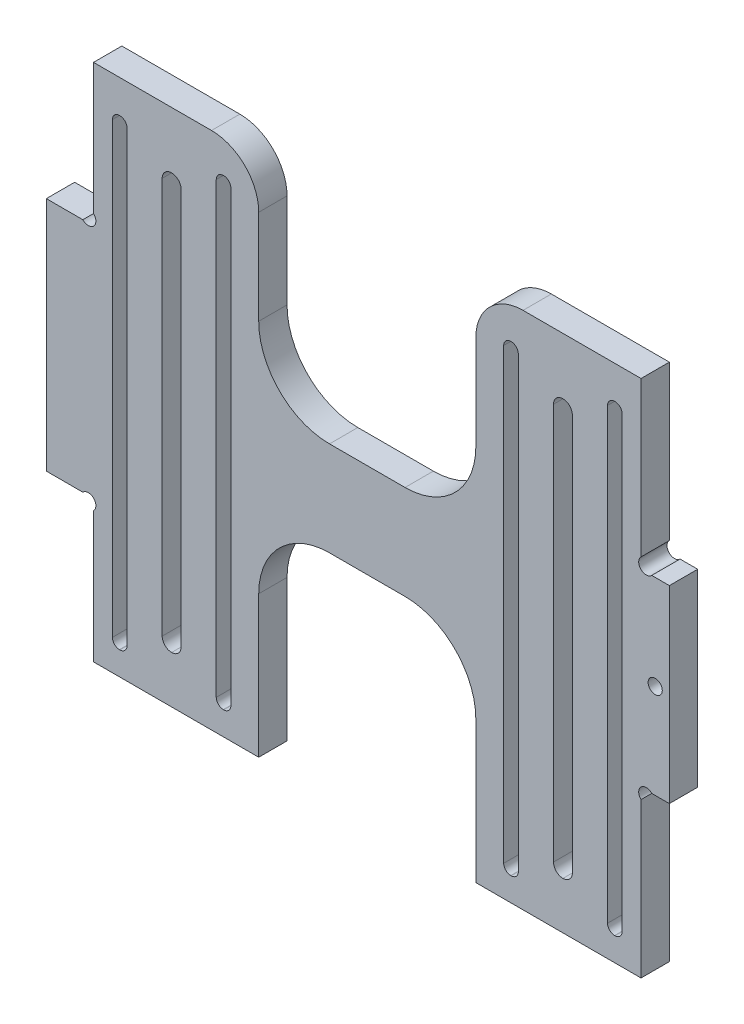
ISO-10303-21;
HEADER;
FILE_DESCRIPTION(('STEP AP214'),'2;1');
FILE_NAME('part.step','',(''),(''),'','','');
FILE_SCHEMA(('AUTOMOTIVE_DESIGN { 1 0 10303 214 1 1 1 1 }'));
ENDSEC;
DATA;
#1=APPLICATION_CONTEXT('core data for automotive mechanical design processes');
#2=APPLICATION_PROTOCOL_DEFINITION('international standard','automotive_design',2000,#1);
#3=PRODUCT_CONTEXT('',#1,'mechanical');
#4=PRODUCT('Part','Part','',(#3));
#5=PRODUCT_RELATED_PRODUCT_CATEGORY('part','',(#4));
#6=PRODUCT_DEFINITION_FORMATION('','',#4);
#7=PRODUCT_DEFINITION_CONTEXT('part definition',#1,'design');
#8=PRODUCT_DEFINITION('design','',#6,#7);
#9=PRODUCT_DEFINITION_SHAPE('','',#8);
#10=(LENGTH_UNIT() NAMED_UNIT(*) SI_UNIT(.MILLI.,.METRE.));
#11=(NAMED_UNIT(*) PLANE_ANGLE_UNIT() SI_UNIT($,.RADIAN.));
#12=(NAMED_UNIT(*) SI_UNIT($,.STERADIAN.) SOLID_ANGLE_UNIT());
#13=UNCERTAINTY_MEASURE_WITH_UNIT(LENGTH_MEASURE(1.E-05),#10,'distance_accuracy_value','');
#14=(GEOMETRIC_REPRESENTATION_CONTEXT(3) GLOBAL_UNCERTAINTY_ASSIGNED_CONTEXT((#13)) GLOBAL_UNIT_ASSIGNED_CONTEXT((#10,
#11,#12)) REPRESENTATION_CONTEXT('',''));
#15=CARTESIAN_POINT('',(0.,0.,0.));
#16=DIRECTION('',(0.,0.,1.));
#17=DIRECTION('',(1.,0.,0.));
#18=AXIS2_PLACEMENT_3D('',#15,#16,#17);
#19=CARTESIAN_POINT('',(-35.2137540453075,-44.1969109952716,6.));
#20=DIRECTION('',(1.,0.,0.));
#21=DIRECTION('',(0.,0.,-1.));
#22=AXIS2_PLACEMENT_3D('',#19,#20,#21);
#23=PLANE('',#22);
#24=DIRECTION('',(0.,-1.,0.));
#25=VECTOR('',#24,1.);
#26=CARTESIAN_POINT('',(-35.2137540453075,-44.1969109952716,0.));
#27=LINE('',#26,#25);
#28=CARTESIAN_POINT('',(-35.2137540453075,65.8030890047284,0.));
#29=VERTEX_POINT('',#28);
#30=CARTESIAN_POINT('',(-35.2137540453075,38.0649840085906,0.));
#31=VERTEX_POINT('',#30);
#32=EDGE_CURVE('E512',#29,#31,#27,.T.);
#33=ORIENTED_EDGE('',*,*,#32,.T.);
#34=DIRECTION('',(0.,0.,-1.));
#35=VECTOR('',#34,1.);
#36=CARTESIAN_POINT('',(-35.2137540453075,38.0649840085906,6.));
#37=LINE('',#36,#35);
#38=CARTESIAN_POINT('',(-35.2137540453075,38.0649840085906,6.));
#39=VERTEX_POINT('',#38);
#40=EDGE_CURVE('E493',#31,#39,#37,.F.);
#41=ORIENTED_EDGE('',*,*,#40,.T.);
#42=DIRECTION('',(0.,-1.,0.));
#43=VECTOR('',#42,1.);
#44=CARTESIAN_POINT('',(-35.2137540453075,-44.1969109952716,6.));
#45=LINE('',#44,#43);
#46=CARTESIAN_POINT('',(-35.2137540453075,65.8030890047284,6.));
#47=VERTEX_POINT('',#46);
#48=EDGE_CURVE('E534',#47,#39,#45,.T.);
#49=ORIENTED_EDGE('',*,*,#48,.F.);
#50=DIRECTION('',(0.,0.,-1.));
#51=VECTOR('',#50,1.);
#52=CARTESIAN_POINT('',(-35.2137540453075,65.8030890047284,6.));
#53=LINE('',#52,#51);
#54=EDGE_CURVE('E520',#47,#29,#53,.T.);
#55=ORIENTED_EDGE('',*,*,#54,.T.);
#56=EDGE_LOOP('',(#33,#41,#49,#55));
#57=FACE_BOUND('',#56,.T.);
#58=ADVANCED_FACE('F33',(#57),#23,.F.);
#59=CARTESIAN_POINT('',(-35.2137540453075,-16.4588059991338,6.));
#60=VERTEX_POINT('',#59);
#61=CARTESIAN_POINT('',(-35.2137540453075,-44.1969109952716,6.));
#62=VERTEX_POINT('',#61);
#63=EDGE_CURVE('E546',#60,#62,#45,.T.);
#64=ORIENTED_EDGE('',*,*,#63,.F.);
#65=DIRECTION('',(0.,0.,-1.));
#66=VECTOR('',#65,1.);
#67=CARTESIAN_POINT('',(-35.2137540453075,-16.4588059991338,6.));
#68=LINE('',#67,#66);
#69=CARTESIAN_POINT('',(-35.2137540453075,-16.4588059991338,0.));
#70=VERTEX_POINT('',#69);
#71=EDGE_CURVE('E898',#60,#70,#68,.T.);
#72=ORIENTED_EDGE('',*,*,#71,.T.);
#73=CARTESIAN_POINT('',(-35.2137540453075,-44.1969109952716,0.));
#74=VERTEX_POINT('',#73);
#75=EDGE_CURVE('E522',#70,#74,#27,.T.);
#76=ORIENTED_EDGE('',*,*,#75,.T.);
#77=DIRECTION('',(0.,0.,-1.));
#78=VECTOR('',#77,1.);
#79=CARTESIAN_POINT('',(-35.2137540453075,-44.1969109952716,6.));
#80=LINE('',#79,#78);
#81=EDGE_CURVE('E555',#62,#74,#80,.T.);
#82=ORIENTED_EDGE('',*,*,#81,.F.);
#83=EDGE_LOOP('',(#64,#72,#76,#82));
#84=FACE_BOUND('',#83,.T.);
#85=ADVANCED_FACE('F1132',(#84),#23,.F.);
#86=CARTESIAN_POINT('',(80.7862459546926,65.8030890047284,6.));
#87=DIRECTION('',(-1.,0.,0.));
#88=DIRECTION('',(0.,-1.,0.));
#89=AXIS2_PLACEMENT_3D('',#86,#87,#88);
#90=PLANE('',#89);
#91=DIRECTION('',(0.,1.,0.));
#92=VECTOR('',#91,1.);
#93=CARTESIAN_POINT('',(80.7862459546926,65.8030890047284,6.));
#94=LINE('',#93,#92);
#95=CARTESIAN_POINT('',(80.7862459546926,33.0649840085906,6.));
#96=VERTEX_POINT('',#95);
#97=CARTESIAN_POINT('',(80.7862459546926,65.8030890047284,6.));
#98=VERTEX_POINT('',#97);
#99=EDGE_CURVE('E827',#96,#98,#94,.T.);
#100=ORIENTED_EDGE('',*,*,#99,.F.);
#101=DIRECTION('',(0.,0.,-1.));
#102=VECTOR('',#101,1.);
#103=CARTESIAN_POINT('',(80.7862459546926,33.0649840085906,6.));
#104=LINE('',#103,#102);
#105=CARTESIAN_POINT('',(80.7862459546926,33.0649840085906,0.));
#106=VERTEX_POINT('',#105);
#107=EDGE_CURVE('E914',#96,#106,#104,.T.);
#108=ORIENTED_EDGE('',*,*,#107,.T.);
#109=DIRECTION('',(0.,1.,0.));
#110=VECTOR('',#109,1.);
#111=CARTESIAN_POINT('',(80.7862459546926,65.8030890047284,0.));
#112=LINE('',#111,#110);
#113=CARTESIAN_POINT('',(80.7862459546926,65.8030890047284,0.));
#114=VERTEX_POINT('',#113);
#115=EDGE_CURVE('E812',#106,#114,#112,.T.);
#116=ORIENTED_EDGE('',*,*,#115,.T.);
#117=DIRECTION('',(0.,0.,-1.));
#118=VECTOR('',#117,1.);
#119=CARTESIAN_POINT('',(80.7862459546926,65.8030890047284,6.));
#120=LINE('',#119,#118);
#121=EDGE_CURVE('E560',#98,#114,#120,.T.);
#122=ORIENTED_EDGE('',*,*,#121,.F.);
#123=EDGE_LOOP('',(#100,#108,#116,#122));
#124=FACE_BOUND('',#123,.T.);
#125=ADVANCED_FACE('F1130',(#124),#90,.F.);
#126=CARTESIAN_POINT('',(80.7862459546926,-44.1969109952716,0.));
#127=VERTEX_POINT('',#126);
#128=CARTESIAN_POINT('',(80.7862459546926,-11.4588059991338,0.));
#129=VERTEX_POINT('',#128);
#130=EDGE_CURVE('E807',#127,#129,#112,.T.);
#131=ORIENTED_EDGE('',*,*,#130,.T.);
#132=DIRECTION('',(0.,0.,-1.));
#133=VECTOR('',#132,1.);
#134=CARTESIAN_POINT('',(80.7862459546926,-11.4588059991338,6.));
#135=LINE('',#134,#133);
#136=CARTESIAN_POINT('',(80.7862459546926,-11.4588059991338,6.));
#137=VERTEX_POINT('',#136);
#138=EDGE_CURVE('E906',#129,#137,#135,.F.);
#139=ORIENTED_EDGE('',*,*,#138,.T.);
#140=CARTESIAN_POINT('',(80.7862459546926,-44.1969109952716,6.));
#141=VERTEX_POINT('',#140);
#142=EDGE_CURVE('E813',#141,#137,#94,.T.);
#143=ORIENTED_EDGE('',*,*,#142,.F.);
#144=DIRECTION('',(0.,0.,-1.));
#145=VECTOR('',#144,1.);
#146=CARTESIAN_POINT('',(80.7862459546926,-44.1969109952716,6.));
#147=LINE('',#146,#145);
#148=EDGE_CURVE('E563',#141,#127,#147,.T.);
#149=ORIENTED_EDGE('',*,*,#148,.T.);
#150=EDGE_LOOP('',(#131,#139,#143,#149));
#151=FACE_BOUND('',#150,.T.);
#152=ADVANCED_FACE('F1090',(#151),#90,.F.);
#153=CARTESIAN_POINT('',(-0.213754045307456,-44.1969109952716,6.));
#154=DIRECTION('',(0.,1.,0.));
#155=DIRECTION('',(-1.,0.,0.));
#156=AXIS2_PLACEMENT_3D('',#153,#154,#155);
#157=PLANE('',#156);
#158=DIRECTION('',(1.,0.,0.));
#159=VECTOR('',#158,1.);
#160=CARTESIAN_POINT('',(-0.213754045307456,-44.1969109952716,0.));
#161=LINE('',#160,#159);
#162=CARTESIAN_POINT('',(-0.213754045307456,-44.1969109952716,0.));
#163=VERTEX_POINT('',#162);
#164=EDGE_CURVE('E1070',#74,#163,#161,.T.);
#165=ORIENTED_EDGE('',*,*,#164,.T.);
#166=DIRECTION('',(0.,0.,-1.));
#167=VECTOR('',#166,1.);
#168=CARTESIAN_POINT('',(-0.213754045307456,-44.1969109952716,6.));
#169=LINE('',#168,#167);
#170=CARTESIAN_POINT('',(-0.213754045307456,-44.1969109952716,6.));
#171=VERTEX_POINT('',#170);
#172=EDGE_CURVE('E569',#171,#163,#169,.T.);
#173=ORIENTED_EDGE('',*,*,#172,.F.);
#174=DIRECTION('',(1.,0.,0.));
#175=VECTOR('',#174,1.);
#176=CARTESIAN_POINT('',(-0.213754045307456,-44.1969109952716,6.));
#177=LINE('',#176,#175);
#178=EDGE_CURVE('E521',#62,#171,#177,.T.);
#179=ORIENTED_EDGE('',*,*,#178,.F.);
#180=ORIENTED_EDGE('',*,*,#81,.T.);
#181=EDGE_LOOP('',(#165,#173,#179,#180));
#182=FACE_BOUND('',#181,.T.);
#183=ADVANCED_FACE('F35',(#182),#157,.F.);
#184=CARTESIAN_POINT('',(-0.213754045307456,0.803089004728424,6.));
#185=DIRECTION('',(-1.,0.,0.));
#186=DIRECTION('',(0.,0.,1.));
#187=AXIS2_PLACEMENT_3D('',#184,#185,#186);
#188=PLANE('',#187);
#189=DIRECTION('',(0.,1.,0.));
#190=VECTOR('',#189,1.);
#191=CARTESIAN_POINT('',(-0.213754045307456,0.803089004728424,0.));
#192=LINE('',#191,#190);
#193=CARTESIAN_POINT('',(-0.213754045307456,-14.1969109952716,0.));
#194=VERTEX_POINT('',#193);
#195=EDGE_CURVE('E1073',#163,#194,#192,.T.);
#196=ORIENTED_EDGE('',*,*,#195,.T.);
#197=DIRECTION('',(0.,0.,-1.));
#198=VECTOR('',#197,1.);
#199=CARTESIAN_POINT('',(-0.213754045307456,-14.1969109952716,6.));
#200=LINE('',#199,#198);
#201=CARTESIAN_POINT('',(-0.213754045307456,-14.1969109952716,6.));
#202=VERTEX_POINT('',#201);
#203=EDGE_CURVE('E591',#194,#202,#200,.F.);
#204=ORIENTED_EDGE('',*,*,#203,.T.);
#205=DIRECTION('',(0.,1.,0.));
#206=VECTOR('',#205,1.);
#207=CARTESIAN_POINT('',(-0.213754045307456,0.803089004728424,6.));
#208=LINE('',#207,#206);
#209=EDGE_CURVE('E525',#171,#202,#208,.T.);
#210=ORIENTED_EDGE('',*,*,#209,.F.);
#211=ORIENTED_EDGE('',*,*,#172,.T.);
#212=EDGE_LOOP('',(#196,#204,#210,#211));
#213=FACE_BOUND('',#212,.T.);
#214=ADVANCED_FACE('F1170',(#213),#188,.F.);
#215=CARTESIAN_POINT('',(45.7862459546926,0.80308900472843,6.));
#216=DIRECTION('',(0.,1.,0.));
#217=DIRECTION('',(-1.,0.,0.));
#218=AXIS2_PLACEMENT_3D('',#215,#216,#217);
#219=PLANE('',#218);
#220=DIRECTION('',(1.,0.,0.));
#221=VECTOR('',#220,1.);
#222=CARTESIAN_POINT('',(45.7862459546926,0.80308900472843,0.));
#223=LINE('',#222,#221);
#224=CARTESIAN_POINT('',(14.7862459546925,0.803089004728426,0.));
#225=VERTEX_POINT('',#224);
#226=CARTESIAN_POINT('',(30.7862459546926,0.803089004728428,0.));
#227=VERTEX_POINT('',#226);
#228=EDGE_CURVE('E1076',#225,#227,#223,.T.);
#229=ORIENTED_EDGE('',*,*,#228,.T.);
#230=DIRECTION('',(0.,0.,-1.));
#231=VECTOR('',#230,1.);
#232=CARTESIAN_POINT('',(30.7862459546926,0.803089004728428,6.));
#233=LINE('',#232,#231);
#234=CARTESIAN_POINT('',(30.7862459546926,0.803089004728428,6.));
#235=VERTEX_POINT('',#234);
#236=EDGE_CURVE('E589',#227,#235,#233,.F.);
#237=ORIENTED_EDGE('',*,*,#236,.T.);
#238=DIRECTION('',(1.,0.,0.));
#239=VECTOR('',#238,1.);
#240=CARTESIAN_POINT('',(45.7862459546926,0.80308900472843,6.));
#241=LINE('',#240,#239);
#242=CARTESIAN_POINT('',(14.7862459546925,0.803089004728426,6.));
#243=VERTEX_POINT('',#242);
#244=EDGE_CURVE('E1188',#243,#235,#241,.T.);
#245=ORIENTED_EDGE('',*,*,#244,.F.);
#246=DIRECTION('',(0.,0.,-1.));
#247=VECTOR('',#246,1.);
#248=CARTESIAN_POINT('',(14.7862459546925,0.803089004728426,0.));
#249=LINE('',#248,#247);
#250=EDGE_CURVE('E586',#243,#225,#249,.T.);
#251=ORIENTED_EDGE('',*,*,#250,.T.);
#252=EDGE_LOOP('',(#229,#237,#245,#251));
#253=FACE_BOUND('',#252,.T.);
#254=ADVANCED_FACE('F1166',(#253),#219,.F.);
#255=CARTESIAN_POINT('',(45.7862459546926,-44.1969109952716,6.));
#256=DIRECTION('',(1.,0.,0.));
#257=DIRECTION('',(0.,0.,-1.));
#258=AXIS2_PLACEMENT_3D('',#255,#256,#257);
#259=PLANE('',#258);
#260=DIRECTION('',(0.,-1.,0.));
#261=VECTOR('',#260,1.);
#262=CARTESIAN_POINT('',(45.7862459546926,-44.1969109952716,6.));
#263=LINE('',#262,#261);
#264=CARTESIAN_POINT('',(45.7862459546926,-14.1969109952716,6.));
#265=VERTEX_POINT('',#264);
#266=CARTESIAN_POINT('',(45.7862459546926,-44.1969109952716,6.));
#267=VERTEX_POINT('',#266);
#268=EDGE_CURVE('E1192',#265,#267,#263,.T.);
#269=ORIENTED_EDGE('',*,*,#268,.F.);
#270=DIRECTION('',(0.,0.,-1.));
#271=VECTOR('',#270,1.);
#272=CARTESIAN_POINT('',(45.7862459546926,-14.1969109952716,0.));
#273=LINE('',#272,#271);
#274=CARTESIAN_POINT('',(45.7862459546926,-14.1969109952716,0.));
#275=VERTEX_POINT('',#274);
#276=EDGE_CURVE('E583',#265,#275,#273,.T.);
#277=ORIENTED_EDGE('',*,*,#276,.T.);
#278=DIRECTION('',(0.,-1.,0.));
#279=VECTOR('',#278,1.);
#280=CARTESIAN_POINT('',(45.7862459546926,-44.1969109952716,0.));
#281=LINE('',#280,#279);
#282=CARTESIAN_POINT('',(45.7862459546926,-44.1969109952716,0.));
#283=VERTEX_POINT('',#282);
#284=EDGE_CURVE('E1078',#275,#283,#281,.T.);
#285=ORIENTED_EDGE('',*,*,#284,.T.);
#286=DIRECTION('',(0.,0.,-1.));
#287=VECTOR('',#286,1.);
#288=CARTESIAN_POINT('',(45.7862459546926,-44.1969109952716,6.));
#289=LINE('',#288,#287);
#290=EDGE_CURVE('E566',#267,#283,#289,.T.);
#291=ORIENTED_EDGE('',*,*,#290,.F.);
#292=EDGE_LOOP('',(#269,#277,#285,#291));
#293=FACE_BOUND('',#292,.T.);
#294=ADVANCED_FACE('F1162',(#293),#259,.F.);
#295=CARTESIAN_POINT('',(80.7862459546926,-44.1969109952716,6.));
#296=DIRECTION('',(0.,1.,0.));
#297=DIRECTION('',(-1.,0.,0.));
#298=AXIS2_PLACEMENT_3D('',#295,#296,#297);
#299=PLANE('',#298);
#300=DIRECTION('',(1.,0.,0.));
#301=VECTOR('',#300,1.);
#302=CARTESIAN_POINT('',(80.7862459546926,-44.1969109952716,0.));
#303=LINE('',#302,#301);
#304=EDGE_CURVE('E819',#283,#127,#303,.T.);
#305=ORIENTED_EDGE('',*,*,#304,.T.);
#306=ORIENTED_EDGE('',*,*,#148,.F.);
#307=DIRECTION('',(1.,0.,0.));
#308=VECTOR('',#307,1.);
#309=CARTESIAN_POINT('',(80.7862459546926,-44.1969109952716,6.));
#310=LINE('',#309,#308);
#311=EDGE_CURVE('E828',#267,#141,#310,.T.);
#312=ORIENTED_EDGE('',*,*,#311,.F.);
#313=ORIENTED_EDGE('',*,*,#290,.T.);
#314=EDGE_LOOP('',(#305,#306,#312,#313));
#315=FACE_BOUND('',#314,.T.);
#316=ADVANCED_FACE('F1085',(#315),#299,.F.);
#317=CARTESIAN_POINT('',(45.7862459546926,65.8030890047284,6.));
#318=DIRECTION('',(0.,-1.,0.));
#319=DIRECTION('',(0.,0.,-1.));
#320=AXIS2_PLACEMENT_3D('',#317,#318,#319);
#321=PLANE('',#320);
#322=DIRECTION('',(-1.,0.,0.));
#323=VECTOR('',#322,1.);
#324=CARTESIAN_POINT('',(45.7862459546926,65.8030890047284,0.));
#325=LINE('',#324,#323);
#326=CARTESIAN_POINT('',(55.7862459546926,65.8030890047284,0.));
#327=VERTEX_POINT('',#326);
#328=EDGE_CURVE('E811',#114,#327,#325,.T.);
#329=ORIENTED_EDGE('',*,*,#328,.T.);
#330=DIRECTION('',(0.,0.,-1.));
#331=VECTOR('',#330,1.);
#332=CARTESIAN_POINT('',(55.7862459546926,65.8030890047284,6.));
#333=LINE('',#332,#331);
#334=CARTESIAN_POINT('',(55.7862459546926,65.8030890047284,6.));
#335=VERTEX_POINT('',#334);
#336=EDGE_CURVE('E863',#327,#335,#333,.F.);
#337=ORIENTED_EDGE('',*,*,#336,.T.);
#338=DIRECTION('',(-1.,0.,0.));
#339=VECTOR('',#338,1.);
#340=CARTESIAN_POINT('',(45.7862459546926,65.8030890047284,6.));
#341=LINE('',#340,#339);
#342=EDGE_CURVE('E834',#98,#335,#341,.T.);
#343=ORIENTED_EDGE('',*,*,#342,.F.);
#344=ORIENTED_EDGE('',*,*,#121,.T.);
#345=EDGE_LOOP('',(#329,#337,#343,#344));
#346=FACE_BOUND('',#345,.T.);
#347=ADVANCED_FACE('F861',(#346),#321,.F.);
#348=CARTESIAN_POINT('',(45.7862459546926,65.8030890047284,6.));
#349=DIRECTION('',(1.,0.,0.));
#350=DIRECTION('',(0.,1.,0.));
#351=AXIS2_PLACEMENT_3D('',#348,#349,#350);
#352=PLANE('',#351);
#353=DIRECTION('',(0.,-1.,0.));
#354=VECTOR('',#353,1.);
#355=CARTESIAN_POINT('',(45.7862459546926,65.8030890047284,6.));
#356=LINE('',#355,#354);
#357=CARTESIAN_POINT('',(45.7862459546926,55.8030890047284,6.));
#358=VERTEX_POINT('',#357);
#359=CARTESIAN_POINT('',(45.7862459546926,35.8030890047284,6.));
#360=VERTEX_POINT('',#359);
#361=EDGE_CURVE('E838',#358,#360,#356,.T.);
#362=ORIENTED_EDGE('',*,*,#361,.F.);
#363=DIRECTION('',(0.,0.,-1.));
#364=VECTOR('',#363,1.);
#365=CARTESIAN_POINT('',(45.7862459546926,55.8030890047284,6.));
#366=LINE('',#365,#364);
#367=CARTESIAN_POINT('',(45.7862459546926,55.8030890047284,0.));
#368=VERTEX_POINT('',#367);
#369=EDGE_CURVE('E880',#358,#368,#366,.T.);
#370=ORIENTED_EDGE('',*,*,#369,.T.);
#371=DIRECTION('',(0.,-1.,0.));
#372=VECTOR('',#371,1.);
#373=CARTESIAN_POINT('',(45.7862459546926,65.8030890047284,0.));
#374=LINE('',#373,#372);
#375=CARTESIAN_POINT('',(45.7862459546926,35.8030890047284,0.));
#376=VERTEX_POINT('',#375);
#377=EDGE_CURVE('E853',#368,#376,#374,.T.);
#378=ORIENTED_EDGE('',*,*,#377,.T.);
#379=DIRECTION('',(0.,0.,-1.));
#380=VECTOR('',#379,1.);
#381=CARTESIAN_POINT('',(45.7862459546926,35.8030890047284,6.));
#382=LINE('',#381,#380);
#383=EDGE_CURVE('E577',#376,#360,#382,.F.);
#384=ORIENTED_EDGE('',*,*,#383,.T.);
#385=EDGE_LOOP('',(#362,#370,#378,#384));
#386=FACE_BOUND('',#385,.T.);
#387=ADVANCED_FACE('F879',(#386),#352,.F.);
#388=CARTESIAN_POINT('',(-0.213754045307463,20.8030890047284,6.));
#389=DIRECTION('',(0.,-1.,0.));
#390=DIRECTION('',(0.,0.,-1.));
#391=AXIS2_PLACEMENT_3D('',#388,#389,#390);
#392=PLANE('',#391);
#393=DIRECTION('',(-1.,0.,0.));
#394=VECTOR('',#393,1.);
#395=CARTESIAN_POINT('',(-0.213754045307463,20.8030890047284,6.));
#396=LINE('',#395,#394);
#397=CARTESIAN_POINT('',(30.7862459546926,20.8030890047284,6.));
#398=VERTEX_POINT('',#397);
#399=CARTESIAN_POINT('',(14.7862459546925,20.8030890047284,6.));
#400=VERTEX_POINT('',#399);
#401=EDGE_CURVE('E840',#398,#400,#396,.T.);
#402=ORIENTED_EDGE('',*,*,#401,.F.);
#403=DIRECTION('',(0.,0.,-1.));
#404=VECTOR('',#403,1.);
#405=CARTESIAN_POINT('',(30.7862459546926,20.8030890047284,0.));
#406=LINE('',#405,#404);
#407=CARTESIAN_POINT('',(30.7862459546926,20.8030890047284,0.));
#408=VERTEX_POINT('',#407);
#409=EDGE_CURVE('E574',#398,#408,#406,.T.);
#410=ORIENTED_EDGE('',*,*,#409,.T.);
#411=DIRECTION('',(-1.,0.,0.));
#412=VECTOR('',#411,1.);
#413=CARTESIAN_POINT('',(-0.213754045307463,20.8030890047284,0.));
#414=LINE('',#413,#412);
#415=CARTESIAN_POINT('',(14.7862459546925,20.8030890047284,0.));
#416=VERTEX_POINT('',#415);
#417=EDGE_CURVE('E850',#408,#416,#414,.T.);
#418=ORIENTED_EDGE('',*,*,#417,.T.);
#419=DIRECTION('',(0.,0.,-1.));
#420=VECTOR('',#419,1.);
#421=CARTESIAN_POINT('',(14.7862459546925,20.8030890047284,6.));
#422=LINE('',#421,#420);
#423=EDGE_CURVE('E572',#416,#400,#422,.F.);
#424=ORIENTED_EDGE('',*,*,#423,.T.);
#425=EDGE_LOOP('',(#402,#410,#418,#424));
#426=FACE_BOUND('',#425,.T.);
#427=ADVANCED_FACE('F1153',(#426),#392,.F.);
#428=CARTESIAN_POINT('',(-0.213754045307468,65.8030890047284,6.));
#429=DIRECTION('',(-1.,0.,0.));
#430=DIRECTION('',(0.,-1.,0.));
#431=AXIS2_PLACEMENT_3D('',#428,#429,#430);
#432=PLANE('',#431);
#433=DIRECTION('',(0.,1.,0.));
#434=VECTOR('',#433,1.);
#435=CARTESIAN_POINT('',(-0.213754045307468,65.8030890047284,0.));
#436=LINE('',#435,#434);
#437=CARTESIAN_POINT('',(-0.213754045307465,35.8030890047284,0.));
#438=VERTEX_POINT('',#437);
#439=CARTESIAN_POINT('',(-0.213754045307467,55.8030890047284,0.));
#440=VERTEX_POINT('',#439);
#441=EDGE_CURVE('E849',#438,#440,#436,.T.);
#442=ORIENTED_EDGE('',*,*,#441,.T.);
#443=DIRECTION('',(0.,0.,-1.));
#444=VECTOR('',#443,1.);
#445=CARTESIAN_POINT('',(-0.213754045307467,55.8030890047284,6.));
#446=LINE('',#445,#444);
#447=CARTESIAN_POINT('',(-0.213754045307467,55.8030890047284,6.));
#448=VERTEX_POINT('',#447);
#449=EDGE_CURVE('E12',#440,#448,#446,.F.);
#450=ORIENTED_EDGE('',*,*,#449,.T.);
#451=DIRECTION('',(0.,1.,0.));
#452=VECTOR('',#451,1.);
#453=CARTESIAN_POINT('',(-0.213754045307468,65.8030890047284,6.));
#454=LINE('',#453,#452);
#455=CARTESIAN_POINT('',(-0.213754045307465,35.8030890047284,6.));
#456=VERTEX_POINT('',#455);
#457=EDGE_CURVE('E842',#456,#448,#454,.T.);
#458=ORIENTED_EDGE('',*,*,#457,.F.);
#459=DIRECTION('',(0.,0.,-1.));
#460=VECTOR('',#459,1.);
#461=CARTESIAN_POINT('',(-0.213754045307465,35.8030890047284,0.));
#462=LINE('',#461,#460);
#463=EDGE_CURVE('E580',#456,#438,#462,.T.);
#464=ORIENTED_EDGE('',*,*,#463,.T.);
#465=EDGE_LOOP('',(#442,#450,#458,#464));
#466=FACE_BOUND('',#465,.T.);
#467=ADVANCED_FACE('F1150',(#466),#432,.F.);
#468=CARTESIAN_POINT('',(-35.2137540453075,65.8030890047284,6.));
#469=DIRECTION('',(0.,-1.,0.));
#470=DIRECTION('',(0.,0.,-1.));
#471=AXIS2_PLACEMENT_3D('',#468,#469,#470);
#472=PLANE('',#471);
#473=DIRECTION('',(-1.,0.,0.));
#474=VECTOR('',#473,1.);
#475=CARTESIAN_POINT('',(-35.2137540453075,65.8030890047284,6.));
#476=LINE('',#475,#474);
#477=CARTESIAN_POINT('',(-10.2137540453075,65.8030890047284,6.));
#478=VERTEX_POINT('',#477);
#479=EDGE_CURVE('E548',#478,#47,#476,.T.);
#480=ORIENTED_EDGE('',*,*,#479,.F.);
#481=DIRECTION('',(0.,0.,-1.));
#482=VECTOR('',#481,1.);
#483=CARTESIAN_POINT('',(-10.2137540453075,65.8030890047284,6.));
#484=LINE('',#483,#482);
#485=CARTESIAN_POINT('',(-10.2137540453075,65.8030890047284,0.));
#486=VERTEX_POINT('',#485);
#487=EDGE_CURVE('E41',#478,#486,#484,.T.);
#488=ORIENTED_EDGE('',*,*,#487,.T.);
#489=DIRECTION('',(-1.,0.,0.));
#490=VECTOR('',#489,1.);
#491=CARTESIAN_POINT('',(-35.2137540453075,65.8030890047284,0.));
#492=LINE('',#491,#490);
#493=EDGE_CURVE('E527',#486,#29,#492,.T.);
#494=ORIENTED_EDGE('',*,*,#493,.T.);
#495=ORIENTED_EDGE('',*,*,#54,.F.);
#496=EDGE_LOOP('',(#480,#488,#494,#495));
#497=FACE_BOUND('',#496,.T.);
#498=ADVANCED_FACE('F848',(#497),#472,.F.);
#499=CARTESIAN_POINT('',(45.7862459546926,-44.1969109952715,6.));
#500=DIRECTION('',(0.,0.,1.));
#501=DIRECTION('',(1.,0.,0.));
#502=AXIS2_PLACEMENT_3D('',#499,#500,#501);
#503=PLANE('',#502);
#504=CARTESIAN_POINT('',(83.7862459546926,10.8030890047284,6.));
#505=DIRECTION('',(0.,0.,1.));
#506=DIRECTION('',(1.,0.,0.));
#507=AXIS2_PLACEMENT_3D('',#504,#505,#506);
#508=CIRCLE('',#507,1.5);
#509=CARTESIAN_POINT('',(85.2862459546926,10.8030890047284,6.));
#510=VERTEX_POINT('',#509);
#511=EDGE_CURVE('E885',#510,#510,#508,.T.);
#512=ORIENTED_EDGE('',*,*,#511,.F.);
#513=EDGE_LOOP('',(#512));
#514=FACE_BOUND('',#513,.T.);
#515=ORIENTED_EDGE('',*,*,#342,.T.);
#516=CARTESIAN_POINT('',(55.7862459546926,55.8030890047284,6.));
#517=DIRECTION('',(0.,0.,1.));
#518=DIRECTION('',(1.,0.,0.));
#519=AXIS2_PLACEMENT_3D('',#516,#517,#518);
#520=CIRCLE('',#519,10.);
#521=EDGE_CURVE('E871',#335,#358,#520,.T.);
#522=ORIENTED_EDGE('',*,*,#521,.T.);
#523=ORIENTED_EDGE('',*,*,#361,.T.);
#524=CARTESIAN_POINT('',(30.7862459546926,35.8030890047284,6.));
#525=DIRECTION('',(0.,0.,1.));
#526=DIRECTION('',(1.,0.,0.));
#527=AXIS2_PLACEMENT_3D('',#524,#525,#526);
#528=CIRCLE('',#527,15.);
#529=EDGE_CURVE('E596',#360,#398,#528,.F.);
#530=ORIENTED_EDGE('',*,*,#529,.T.);
#531=ORIENTED_EDGE('',*,*,#401,.T.);
#532=CARTESIAN_POINT('',(14.7862459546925,35.8030890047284,6.));
#533=DIRECTION('',(0.,0.,1.));
#534=DIRECTION('',(1.,0.,0.));
#535=AXIS2_PLACEMENT_3D('',#532,#533,#534);
#536=CIRCLE('',#535,15.);
#537=EDGE_CURVE('E600',#400,#456,#536,.F.);
#538=ORIENTED_EDGE('',*,*,#537,.T.);
#539=ORIENTED_EDGE('',*,*,#457,.T.);
#540=CARTESIAN_POINT('',(-10.2137540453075,55.8030890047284,6.));
#541=DIRECTION('',(0.,0.,1.));
#542=DIRECTION('',(1.,0.,0.));
#543=AXIS2_PLACEMENT_3D('',#540,#541,#542);
#544=CIRCLE('',#543,10.);
#545=EDGE_CURVE('E48',#448,#478,#544,.T.);
#546=ORIENTED_EDGE('',*,*,#545,.T.);
#547=ORIENTED_EDGE('',*,*,#479,.T.);
#548=ORIENTED_EDGE('',*,*,#48,.T.);
#549=CARTESIAN_POINT('',(-36.3137540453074,36.9030890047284,6.));
#550=DIRECTION('',(0.,0.,-1.));
#551=DIRECTION('',(-1.,0.,0.));
#552=AXIS2_PLACEMENT_3D('',#549,#550,#551);
#553=CIRCLE('',#552,1.6);
#554=CARTESIAN_POINT('',(-37.4756490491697,35.8030890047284,6.));
#555=VERTEX_POINT('',#554);
#556=EDGE_CURVE('E499',#39,#555,#553,.T.);
#557=ORIENTED_EDGE('',*,*,#556,.T.);
#558=DIRECTION('',(1.,0.,0.));
#559=VECTOR('',#558,1.);
#560=CARTESIAN_POINT('',(-45.2137540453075,35.8030890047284,6.));
#561=LINE('',#560,#559);
#562=CARTESIAN_POINT('',(-45.2137540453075,35.8030890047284,6.));
#563=VERTEX_POINT('',#562);
#564=EDGE_CURVE('E1989',#563,#555,#561,.T.);
#565=ORIENTED_EDGE('',*,*,#564,.F.);
#566=DIRECTION('',(0.,1.,0.));
#567=VECTOR('',#566,1.);
#568=CARTESIAN_POINT('',(-45.2137540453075,-14.1969109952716,6.));
#569=LINE('',#568,#567);
#570=CARTESIAN_POINT('',(-45.2137540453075,-14.1969109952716,6.));
#571=VERTEX_POINT('',#570);
#572=EDGE_CURVE('E922',#571,#563,#569,.T.);
#573=ORIENTED_EDGE('',*,*,#572,.F.);
#574=DIRECTION('',(1.,0.,0.));
#575=VECTOR('',#574,1.);
#576=CARTESIAN_POINT('',(-45.2137540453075,-14.1969109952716,6.));
#577=LINE('',#576,#575);
#578=CARTESIAN_POINT('',(-37.4756490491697,-14.1969109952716,6.));
#579=VERTEX_POINT('',#578);
#580=EDGE_CURVE('E1985',#571,#579,#577,.T.);
#581=ORIENTED_EDGE('',*,*,#580,.T.);
#582=CARTESIAN_POINT('',(-36.3137540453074,-15.2969109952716,6.));
#583=DIRECTION('',(0.,0.,-1.));
#584=DIRECTION('',(-1.,0.,0.));
#585=AXIS2_PLACEMENT_3D('',#582,#583,#584);
#586=CIRCLE('',#585,1.6);
#587=EDGE_CURVE('E895',#579,#60,#586,.T.);
#588=ORIENTED_EDGE('',*,*,#587,.T.);
#589=ORIENTED_EDGE('',*,*,#63,.T.);
#590=ORIENTED_EDGE('',*,*,#178,.T.);
#591=ORIENTED_EDGE('',*,*,#209,.T.);
#592=CARTESIAN_POINT('',(14.7862459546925,-14.1969109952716,6.));
#593=DIRECTION('',(0.,0.,1.));
#594=DIRECTION('',(1.,0.,0.));
#595=AXIS2_PLACEMENT_3D('',#592,#593,#594);
#596=CIRCLE('',#595,15.);
#597=EDGE_CURVE('E608',#202,#243,#596,.F.);
#598=ORIENTED_EDGE('',*,*,#597,.T.);
#599=ORIENTED_EDGE('',*,*,#244,.T.);
#600=CARTESIAN_POINT('',(30.7862459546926,-14.1969109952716,6.));
#601=DIRECTION('',(0.,0.,1.));
#602=DIRECTION('',(1.,0.,0.));
#603=AXIS2_PLACEMENT_3D('',#600,#601,#602);
#604=CIRCLE('',#603,15.);
#605=EDGE_CURVE('E604',#235,#265,#604,.F.);
#606=ORIENTED_EDGE('',*,*,#605,.T.);
#607=ORIENTED_EDGE('',*,*,#268,.T.);
#608=ORIENTED_EDGE('',*,*,#311,.T.);
#609=ORIENTED_EDGE('',*,*,#142,.T.);
#610=CARTESIAN_POINT('',(81.8862459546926,-10.2969109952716,6.));
#611=DIRECTION('',(0.,0.,-1.));
#612=DIRECTION('',(-1.,0.,0.));
#613=AXIS2_PLACEMENT_3D('',#610,#611,#612);
#614=CIRCLE('',#613,1.6);
#615=CARTESIAN_POINT('',(83.0481409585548,-9.19691099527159,6.));
#616=VERTEX_POINT('',#615);
#617=EDGE_CURVE('E903',#137,#616,#614,.T.);
#618=ORIENTED_EDGE('',*,*,#617,.T.);
#619=DIRECTION('',(-1.,0.,0.));
#620=VECTOR('',#619,1.);
#621=CARTESIAN_POINT('',(86.7862459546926,-9.19691099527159,6.));
#622=LINE('',#621,#620);
#623=CARTESIAN_POINT('',(86.7862459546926,-9.19691099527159,6.));
#624=VERTEX_POINT('',#623);
#625=EDGE_CURVE('E941',#624,#616,#622,.T.);
#626=ORIENTED_EDGE('',*,*,#625,.F.);
#627=DIRECTION('',(0.,-1.,0.));
#628=VECTOR('',#627,1.);
#629=CARTESIAN_POINT('',(86.7862459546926,30.8030890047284,6.));
#630=LINE('',#629,#628);
#631=CARTESIAN_POINT('',(86.7862459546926,30.8030890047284,6.));
#632=VERTEX_POINT('',#631);
#633=EDGE_CURVE('E926',#632,#624,#630,.T.);
#634=ORIENTED_EDGE('',*,*,#633,.F.);
#635=DIRECTION('',(-1.,0.,0.));
#636=VECTOR('',#635,1.);
#637=CARTESIAN_POINT('',(86.7862459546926,30.8030890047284,6.));
#638=LINE('',#637,#636);
#639=CARTESIAN_POINT('',(83.0481409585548,30.8030890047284,6.));
#640=VERTEX_POINT('',#639);
#641=EDGE_CURVE('E936',#632,#640,#638,.T.);
#642=ORIENTED_EDGE('',*,*,#641,.T.);
#643=CARTESIAN_POINT('',(81.8862459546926,31.9030890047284,6.));
#644=DIRECTION('',(0.,0.,-1.));
#645=DIRECTION('',(-1.,0.,0.));
#646=AXIS2_PLACEMENT_3D('',#643,#644,#645);
#647=CIRCLE('',#646,1.60000000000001);
#648=EDGE_CURVE('E911',#640,#96,#647,.T.);
#649=ORIENTED_EDGE('',*,*,#648,.T.);
#650=ORIENTED_EDGE('',*,*,#99,.T.);
#651=EDGE_LOOP('',(#515,#522,#523,#530,#531,#538,#539,#546,#547,#548,#557,#565,#573,#581,#588,
#589,#590,#591,#598,#599,#606,#607,#608,#609,#618,#626,#634,#642,#649,#650));
#652=FACE_BOUND('',#651,.T.);
#653=CARTESIAN_POINT('',(-18.6637540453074,51.8030890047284,6.));
#654=DIRECTION('',(0.,0.,1.));
#655=DIRECTION('',(1.,0.,0.));
#656=AXIS2_PLACEMENT_3D('',#653,#654,#655);
#657=CIRCLE('',#656,2.);
#658=CARTESIAN_POINT('',(-20.6637540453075,51.8030890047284,6.));
#659=VERTEX_POINT('',#658);
#660=CARTESIAN_POINT('',(-18.6637540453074,53.8030890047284,6.));
#661=VERTEX_POINT('',#660);
#662=EDGE_CURVE('E774',#659,#661,#657,.F.);
#663=ORIENTED_EDGE('',*,*,#662,.T.);
#664=CARTESIAN_POINT('',(-18.6637540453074,51.8030890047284,6.));
#665=DIRECTION('',(0.,0.,1.));
#666=DIRECTION('',(1.,0.,0.));
#667=AXIS2_PLACEMENT_3D('',#664,#665,#666);
#668=CIRCLE('',#667,2.);
#669=CARTESIAN_POINT('',(-16.6637540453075,51.8030890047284,6.));
#670=VERTEX_POINT('',#669);
#671=EDGE_CURVE('E778',#661,#670,#668,.F.);
#672=ORIENTED_EDGE('',*,*,#671,.T.);
#673=DIRECTION('',(0.,1.,0.));
#674=VECTOR('',#673,1.);
#675=CARTESIAN_POINT('',(-16.6637540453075,53.8030890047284,6.));
#676=LINE('',#675,#674);
#677=CARTESIAN_POINT('',(-16.6637540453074,-32.1969109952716,6.));
#678=VERTEX_POINT('',#677);
#679=EDGE_CURVE('E953',#678,#670,#676,.T.);
#680=ORIENTED_EDGE('',*,*,#679,.F.);
#681=CARTESIAN_POINT('',(-18.6637540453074,-32.1969109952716,6.));
#682=DIRECTION('',(0.,0.,1.));
#683=DIRECTION('',(1.,0.,0.));
#684=AXIS2_PLACEMENT_3D('',#681,#682,#683);
#685=CIRCLE('',#684,2.);
#686=CARTESIAN_POINT('',(-18.6637540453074,-34.1969109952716,6.));
#687=VERTEX_POINT('',#686);
#688=EDGE_CURVE('E782',#678,#687,#685,.F.);
#689=ORIENTED_EDGE('',*,*,#688,.T.);
#690=CARTESIAN_POINT('',(-18.6637540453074,-32.1969109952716,6.));
#691=DIRECTION('',(0.,0.,1.));
#692=DIRECTION('',(1.,0.,0.));
#693=AXIS2_PLACEMENT_3D('',#690,#691,#692);
#694=CIRCLE('',#693,2.);
#695=CARTESIAN_POINT('',(-20.6637540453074,-32.1969109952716,6.));
#696=VERTEX_POINT('',#695);
#697=EDGE_CURVE('E786',#687,#696,#694,.F.);
#698=ORIENTED_EDGE('',*,*,#697,.T.);
#699=DIRECTION('',(0.,-1.,0.));
#700=VECTOR('',#699,1.);
#701=CARTESIAN_POINT('',(-20.6637540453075,53.8030890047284,6.));
#702=LINE('',#701,#700);
#703=EDGE_CURVE('E950',#659,#696,#702,.T.);
#704=ORIENTED_EDGE('',*,*,#703,.F.);
#705=EDGE_LOOP('',(#663,#672,#680,#689,#698,#704));
#706=FACE_BOUND('',#705,.T.);
#707=DIRECTION('',(0.,-1.,0.));
#708=VECTOR('',#707,1.);
#709=CARTESIAN_POINT('',(62.2362459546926,53.8030890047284,6.));
#710=LINE('',#709,#708);
#711=CARTESIAN_POINT('',(62.2362459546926,51.8030890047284,6.));
#712=VERTEX_POINT('',#711);
#713=CARTESIAN_POINT('',(62.2362459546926,-32.1969109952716,6.));
#714=VERTEX_POINT('',#713);
#715=EDGE_CURVE('E962',#712,#714,#710,.T.);
#716=ORIENTED_EDGE('',*,*,#715,.F.);
#717=CARTESIAN_POINT('',(64.2362459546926,51.8030890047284,6.));
#718=DIRECTION('',(0.,0.,1.));
#719=DIRECTION('',(1.,0.,0.));
#720=AXIS2_PLACEMENT_3D('',#717,#718,#719);
#721=CIRCLE('',#720,2.);
#722=CARTESIAN_POINT('',(64.2362459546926,53.8030890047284,6.));
#723=VERTEX_POINT('',#722);
#724=EDGE_CURVE('E802',#712,#723,#721,.F.);
#725=ORIENTED_EDGE('',*,*,#724,.T.);
#726=CARTESIAN_POINT('',(64.2362459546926,51.8030890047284,6.));
#727=DIRECTION('',(0.,0.,1.));
#728=DIRECTION('',(1.,0.,0.));
#729=AXIS2_PLACEMENT_3D('',#726,#727,#728);
#730=CIRCLE('',#729,2.);
#731=CARTESIAN_POINT('',(66.2362459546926,51.8030890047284,6.));
#732=VERTEX_POINT('',#731);
#733=EDGE_CURVE('E798',#723,#732,#730,.F.);
#734=ORIENTED_EDGE('',*,*,#733,.T.);
#735=DIRECTION('',(0.,1.,0.));
#736=VECTOR('',#735,1.);
#737=CARTESIAN_POINT('',(66.2362459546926,53.8030890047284,6.));
#738=LINE('',#737,#736);
#739=CARTESIAN_POINT('',(66.2362459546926,-32.1969109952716,6.));
#740=VERTEX_POINT('',#739);
#741=EDGE_CURVE('E965',#740,#732,#738,.T.);
#742=ORIENTED_EDGE('',*,*,#741,.F.);
#743=CARTESIAN_POINT('',(64.2362459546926,-32.1969109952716,6.));
#744=DIRECTION('',(0.,0.,1.));
#745=DIRECTION('',(1.,0.,0.));
#746=AXIS2_PLACEMENT_3D('',#743,#744,#745);
#747=CIRCLE('',#746,2.);
#748=CARTESIAN_POINT('',(64.2362459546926,-34.1969109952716,6.));
#749=VERTEX_POINT('',#748);
#750=EDGE_CURVE('E794',#740,#749,#747,.F.);
#751=ORIENTED_EDGE('',*,*,#750,.T.);
#752=CARTESIAN_POINT('',(64.2362459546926,-32.1969109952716,6.));
#753=DIRECTION('',(0.,0.,1.));
#754=DIRECTION('',(1.,0.,0.));
#755=AXIS2_PLACEMENT_3D('',#752,#753,#754);
#756=CIRCLE('',#755,2.);
#757=EDGE_CURVE('E790',#749,#714,#756,.F.);
#758=ORIENTED_EDGE('',*,*,#757,.T.);
#759=EDGE_LOOP('',(#716,#725,#734,#742,#751,#758));
#760=FACE_BOUND('',#759,.T.);
#761=DIRECTION('',(0.,-1.,0.));
#762=VECTOR('',#761,1.);
#763=CARTESIAN_POINT('',(-9.21375404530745,-39.1969109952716,6.));
#764=LINE('',#763,#762);
#765=CARTESIAN_POINT('',(-9.21375404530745,57.3030890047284,6.));
#766=VERTEX_POINT('',#765);
#767=CARTESIAN_POINT('',(-9.21375404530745,-37.6969109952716,6.));
#768=VERTEX_POINT('',#767);
#769=EDGE_CURVE('E974',#766,#768,#764,.T.);
#770=ORIENTED_EDGE('',*,*,#769,.F.);
#771=CARTESIAN_POINT('',(-7.71375404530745,57.3030890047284,6.));
#772=DIRECTION('',(0.,0.,1.));
#773=DIRECTION('',(1.,0.,0.));
#774=AXIS2_PLACEMENT_3D('',#771,#772,#773);
#775=CIRCLE('',#774,1.5);
#776=CARTESIAN_POINT('',(-7.71375404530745,58.8030890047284,6.));
#777=VERTEX_POINT('',#776);
#778=EDGE_CURVE('E746',#766,#777,#775,.F.);
#779=ORIENTED_EDGE('',*,*,#778,.T.);
#780=DIRECTION('',(-1.,0.,0.));
#781=VECTOR('',#780,1.);
#782=CARTESIAN_POINT('',(-9.21375404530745,58.8030890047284,6.));
#783=LINE('',#782,#781);
#784=CARTESIAN_POINT('',(-7.61375404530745,58.8030890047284,6.));
#785=VERTEX_POINT('',#784);
#786=EDGE_CURVE('E983',#785,#777,#783,.T.);
#787=ORIENTED_EDGE('',*,*,#786,.F.);
#788=CARTESIAN_POINT('',(-7.61375404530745,57.3030890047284,6.));
#789=DIRECTION('',(0.,0.,1.));
#790=DIRECTION('',(1.,0.,0.));
#791=AXIS2_PLACEMENT_3D('',#788,#789,#790);
#792=CIRCLE('',#791,1.5);
#793=CARTESIAN_POINT('',(-6.11375404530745,57.3030890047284,6.));
#794=VERTEX_POINT('',#793);
#795=EDGE_CURVE('E750',#785,#794,#792,.F.);
#796=ORIENTED_EDGE('',*,*,#795,.T.);
#797=DIRECTION('',(0.,1.,0.));
#798=VECTOR('',#797,1.);
#799=CARTESIAN_POINT('',(-6.11375404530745,-39.1969109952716,6.));
#800=LINE('',#799,#798);
#801=CARTESIAN_POINT('',(-6.11375404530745,-37.6969109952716,6.));
#802=VERTEX_POINT('',#801);
#803=EDGE_CURVE('E980',#802,#794,#800,.T.);
#804=ORIENTED_EDGE('',*,*,#803,.F.);
#805=CARTESIAN_POINT('',(-7.61375404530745,-37.6969109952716,6.));
#806=DIRECTION('',(0.,0.,1.));
#807=DIRECTION('',(1.,0.,0.));
#808=AXIS2_PLACEMENT_3D('',#805,#806,#807);
#809=CIRCLE('',#808,1.5);
#810=CARTESIAN_POINT('',(-7.61375404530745,-39.1969109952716,6.));
#811=VERTEX_POINT('',#810);
#812=EDGE_CURVE('E744',#802,#811,#809,.F.);
#813=ORIENTED_EDGE('',*,*,#812,.T.);
#814=DIRECTION('',(1.,0.,0.));
#815=VECTOR('',#814,1.);
#816=CARTESIAN_POINT('',(-9.21375404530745,-39.1969109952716,6.));
#817=LINE('',#816,#815);
#818=CARTESIAN_POINT('',(-7.71375404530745,-39.1969109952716,6.));
#819=VERTEX_POINT('',#818);
#820=EDGE_CURVE('E977',#819,#811,#817,.T.);
#821=ORIENTED_EDGE('',*,*,#820,.F.);
#822=CARTESIAN_POINT('',(-7.71375404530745,-37.6969109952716,6.));
#823=DIRECTION('',(0.,0.,1.));
#824=DIRECTION('',(1.,0.,0.));
#825=AXIS2_PLACEMENT_3D('',#822,#823,#824);
#826=CIRCLE('',#825,1.5);
#827=EDGE_CURVE('E738',#819,#768,#826,.F.);
#828=ORIENTED_EDGE('',*,*,#827,.T.);
#829=EDGE_LOOP('',(#770,#779,#787,#796,#804,#813,#821,#828));
#830=FACE_BOUND('',#829,.T.);
#831=DIRECTION('',(0.,-1.,0.));
#832=VECTOR('',#831,1.);
#833=CARTESIAN_POINT('',(-31.2137540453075,-39.1969109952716,6.));
#834=LINE('',#833,#832);
#835=CARTESIAN_POINT('',(-31.2137540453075,57.3030890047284,6.));
#836=VERTEX_POINT('',#835);
#837=CARTESIAN_POINT('',(-31.2137540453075,-37.6969109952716,6.));
#838=VERTEX_POINT('',#837);
#839=EDGE_CURVE('E998',#836,#838,#834,.T.);
#840=ORIENTED_EDGE('',*,*,#839,.F.);
#841=CARTESIAN_POINT('',(-29.7137540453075,57.3030890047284,6.));
#842=DIRECTION('',(0.,0.,1.));
#843=DIRECTION('',(1.,0.,0.));
#844=AXIS2_PLACEMENT_3D('',#841,#842,#843);
#845=CIRCLE('',#844,1.5);
#846=CARTESIAN_POINT('',(-29.7137540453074,58.8030890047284,6.));
#847=VERTEX_POINT('',#846);
#848=EDGE_CURVE('E748',#836,#847,#845,.F.);
#849=ORIENTED_EDGE('',*,*,#848,.T.);
#850=DIRECTION('',(-1.,0.,0.));
#851=VECTOR('',#850,1.);
#852=CARTESIAN_POINT('',(-31.2137540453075,58.8030890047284,6.));
#853=LINE('',#852,#851);
#854=CARTESIAN_POINT('',(-29.6137540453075,58.8030890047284,6.));
#855=VERTEX_POINT('',#854);
#856=EDGE_CURVE('E1007',#855,#847,#853,.T.);
#857=ORIENTED_EDGE('',*,*,#856,.F.);
#858=CARTESIAN_POINT('',(-29.6137540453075,57.3030890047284,6.));
#859=DIRECTION('',(0.,0.,1.));
#860=DIRECTION('',(1.,0.,0.));
#861=AXIS2_PLACEMENT_3D('',#858,#859,#860);
#862=CIRCLE('',#861,1.5);
#863=CARTESIAN_POINT('',(-28.1137540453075,57.3030890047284,6.));
#864=VERTEX_POINT('',#863);
#865=EDGE_CURVE('E752',#855,#864,#862,.F.);
#866=ORIENTED_EDGE('',*,*,#865,.T.);
#867=DIRECTION('',(0.,1.,0.));
#868=VECTOR('',#867,1.);
#869=CARTESIAN_POINT('',(-28.1137540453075,-39.1969109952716,6.));
#870=LINE('',#869,#868);
#871=CARTESIAN_POINT('',(-28.1137540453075,-37.6969109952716,6.));
#872=VERTEX_POINT('',#871);
#873=EDGE_CURVE('E1004',#872,#864,#870,.T.);
#874=ORIENTED_EDGE('',*,*,#873,.F.);
#875=CARTESIAN_POINT('',(-29.6137540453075,-37.6969109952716,6.));
#876=DIRECTION('',(0.,0.,1.));
#877=DIRECTION('',(1.,0.,0.));
#878=AXIS2_PLACEMENT_3D('',#875,#876,#877);
#879=CIRCLE('',#878,1.5);
#880=CARTESIAN_POINT('',(-29.6137540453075,-39.1969109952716,6.));
#881=VERTEX_POINT('',#880);
#882=EDGE_CURVE('E742',#872,#881,#879,.F.);
#883=ORIENTED_EDGE('',*,*,#882,.T.);
#884=DIRECTION('',(1.,0.,0.));
#885=VECTOR('',#884,1.);
#886=CARTESIAN_POINT('',(-31.2137540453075,-39.1969109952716,6.));
#887=LINE('',#886,#885);
#888=CARTESIAN_POINT('',(-29.7137540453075,-39.1969109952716,6.));
#889=VERTEX_POINT('',#888);
#890=EDGE_CURVE('E1001',#889,#881,#887,.T.);
#891=ORIENTED_EDGE('',*,*,#890,.F.);
#892=CARTESIAN_POINT('',(-29.7137540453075,-37.6969109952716,6.));
#893=DIRECTION('',(0.,0.,1.));
#894=DIRECTION('',(1.,0.,0.));
#895=AXIS2_PLACEMENT_3D('',#892,#893,#894);
#896=CIRCLE('',#895,1.5);
#897=EDGE_CURVE('E740',#889,#838,#896,.F.);
#898=ORIENTED_EDGE('',*,*,#897,.T.);
#899=EDGE_LOOP('',(#840,#849,#857,#866,#874,#883,#891,#898));
#900=FACE_BOUND('',#899,.T.);
#901=DIRECTION('',(0.,-1.,0.));
#902=VECTOR('',#901,1.);
#903=CARTESIAN_POINT('',(51.6862459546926,58.8030890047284,6.));
#904=LINE('',#903,#902);
#905=CARTESIAN_POINT('',(51.6862459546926,57.3030890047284,6.));
#906=VERTEX_POINT('',#905);
#907=CARTESIAN_POINT('',(51.6862459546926,-37.6969109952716,6.));
#908=VERTEX_POINT('',#907);
#909=EDGE_CURVE('E1022',#906,#908,#904,.T.);
#910=ORIENTED_EDGE('',*,*,#909,.F.);
#911=CARTESIAN_POINT('',(53.1862459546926,57.3030890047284,6.));
#912=DIRECTION('',(0.,0.,1.));
#913=DIRECTION('',(1.,0.,0.));
#914=AXIS2_PLACEMENT_3D('',#911,#912,#913);
#915=CIRCLE('',#914,1.5);
#916=CARTESIAN_POINT('',(53.1862459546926,58.8030890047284,6.));
#917=VERTEX_POINT('',#916);
#918=EDGE_CURVE('E724',#906,#917,#915,.F.);
#919=ORIENTED_EDGE('',*,*,#918,.T.);
#920=DIRECTION('',(-1.,0.,0.));
#921=VECTOR('',#920,1.);
#922=CARTESIAN_POINT('',(51.6862459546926,58.8030890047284,6.));
#923=LINE('',#922,#921);
#924=CARTESIAN_POINT('',(53.2862459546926,58.8030890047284,6.));
#925=VERTEX_POINT('',#924);
#926=EDGE_CURVE('E1031',#925,#917,#923,.T.);
#927=ORIENTED_EDGE('',*,*,#926,.F.);
#928=CARTESIAN_POINT('',(53.2862459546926,57.3030890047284,6.));
#929=DIRECTION('',(0.,0.,1.));
#930=DIRECTION('',(1.,0.,0.));
#931=AXIS2_PLACEMENT_3D('',#928,#929,#930);
#932=CIRCLE('',#931,1.5);
#933=CARTESIAN_POINT('',(54.7862459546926,57.3030890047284,6.));
#934=VERTEX_POINT('',#933);
#935=EDGE_CURVE('E726',#925,#934,#932,.F.);
#936=ORIENTED_EDGE('',*,*,#935,.T.);
#937=DIRECTION('',(0.,1.,0.));
#938=VECTOR('',#937,1.);
#939=CARTESIAN_POINT('',(54.7862459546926,58.8030890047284,6.));
#940=LINE('',#939,#938);
#941=CARTESIAN_POINT('',(54.7862459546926,-37.6969109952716,6.));
#942=VERTEX_POINT('',#941);
#943=EDGE_CURVE('E1028',#942,#934,#940,.T.);
#944=ORIENTED_EDGE('',*,*,#943,.F.);
#945=CARTESIAN_POINT('',(53.2862459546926,-37.6969109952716,6.));
#946=DIRECTION('',(0.,0.,1.));
#947=DIRECTION('',(1.,0.,0.));
#948=AXIS2_PLACEMENT_3D('',#945,#946,#947);
#949=CIRCLE('',#948,1.5);
#950=CARTESIAN_POINT('',(53.2862459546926,-39.1969109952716,6.));
#951=VERTEX_POINT('',#950);
#952=EDGE_CURVE('E732',#942,#951,#949,.F.);
#953=ORIENTED_EDGE('',*,*,#952,.T.);
#954=DIRECTION('',(1.,0.,0.));
#955=VECTOR('',#954,1.);
#956=CARTESIAN_POINT('',(51.6862459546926,-39.1969109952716,6.));
#957=LINE('',#956,#955);
#958=CARTESIAN_POINT('',(53.1862459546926,-39.1969109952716,6.));
#959=VERTEX_POINT('',#958);
#960=EDGE_CURVE('E1025',#959,#951,#957,.T.);
#961=ORIENTED_EDGE('',*,*,#960,.F.);
#962=CARTESIAN_POINT('',(53.1862459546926,-37.6969109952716,6.));
#963=DIRECTION('',(0.,0.,1.));
#964=DIRECTION('',(1.,0.,0.));
#965=AXIS2_PLACEMENT_3D('',#962,#963,#964);
#966=CIRCLE('',#965,1.5);
#967=EDGE_CURVE('E736',#959,#908,#966,.F.);
#968=ORIENTED_EDGE('',*,*,#967,.T.);
#969=EDGE_LOOP('',(#910,#919,#927,#936,#944,#953,#961,#968));
#970=FACE_BOUND('',#969,.T.);
#971=DIRECTION('',(0.,-1.,0.));
#972=VECTOR('',#971,1.);
#973=CARTESIAN_POINT('',(73.6862459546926,58.8030890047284,6.));
#974=LINE('',#973,#972);
#975=CARTESIAN_POINT('',(73.6862459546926,57.3030890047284,6.));
#976=VERTEX_POINT('',#975);
#977=CARTESIAN_POINT('',(73.6862459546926,-37.6969109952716,6.));
#978=VERTEX_POINT('',#977);
#979=EDGE_CURVE('E1046',#976,#978,#974,.T.);
#980=ORIENTED_EDGE('',*,*,#979,.F.);
#981=CARTESIAN_POINT('',(75.1862459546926,57.3030890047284,6.));
#982=DIRECTION('',(0.,0.,1.));
#983=DIRECTION('',(1.,0.,0.));
#984=AXIS2_PLACEMENT_3D('',#981,#982,#983);
#985=CIRCLE('',#984,1.5);
#986=CARTESIAN_POINT('',(75.1862459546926,58.8030890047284,6.));
#987=VERTEX_POINT('',#986);
#988=EDGE_CURVE('E722',#976,#987,#985,.F.);
#989=ORIENTED_EDGE('',*,*,#988,.T.);
#990=DIRECTION('',(-1.,0.,0.));
#991=VECTOR('',#990,1.);
#992=CARTESIAN_POINT('',(73.6862459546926,58.8030890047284,6.));
#993=LINE('',#992,#991);
#994=CARTESIAN_POINT('',(75.2862459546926,58.8030890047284,6.));
#995=VERTEX_POINT('',#994);
#996=EDGE_CURVE('E1055',#995,#987,#993,.T.);
#997=ORIENTED_EDGE('',*,*,#996,.F.);
#998=CARTESIAN_POINT('',(75.2862459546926,57.3030890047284,6.));
#999=DIRECTION('',(0.,0.,1.));
#1000=DIRECTION('',(1.,0.,0.));
#1001=AXIS2_PLACEMENT_3D('',#998,#999,#1000);
#1002=CIRCLE('',#1001,1.5);
#1003=CARTESIAN_POINT('',(76.7862459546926,57.3030890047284,6.));
#1004=VERTEX_POINT('',#1003);
#1005=EDGE_CURVE('E728',#995,#1004,#1002,.F.);
#1006=ORIENTED_EDGE('',*,*,#1005,.T.);
#1007=DIRECTION('',(0.,1.,0.));
#1008=VECTOR('',#1007,1.);
#1009=CARTESIAN_POINT('',(76.7862459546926,58.8030890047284,6.));
#1010=LINE('',#1009,#1008);
#1011=CARTESIAN_POINT('',(76.7862459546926,-37.6969109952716,6.));
#1012=VERTEX_POINT('',#1011);
#1013=EDGE_CURVE('E1052',#1012,#1004,#1010,.T.);
#1014=ORIENTED_EDGE('',*,*,#1013,.F.);
#1015=CARTESIAN_POINT('',(75.2862459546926,-37.6969109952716,6.));
#1016=DIRECTION('',(0.,0.,1.));
#1017=DIRECTION('',(1.,0.,0.));
#1018=AXIS2_PLACEMENT_3D('',#1015,#1016,#1017);
#1019=CIRCLE('',#1018,1.5);
#1020=CARTESIAN_POINT('',(75.2862459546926,-39.1969109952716,6.));
#1021=VERTEX_POINT('',#1020);
#1022=EDGE_CURVE('E730',#1012,#1021,#1019,.F.);
#1023=ORIENTED_EDGE('',*,*,#1022,.T.);
#1024=DIRECTION('',(1.,0.,0.));
#1025=VECTOR('',#1024,1.);
#1026=CARTESIAN_POINT('',(73.6862459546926,-39.1969109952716,6.));
#1027=LINE('',#1026,#1025);
#1028=CARTESIAN_POINT('',(75.1862459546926,-39.1969109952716,6.));
#1029=VERTEX_POINT('',#1028);
#1030=EDGE_CURVE('E1049',#1029,#1021,#1027,.T.);
#1031=ORIENTED_EDGE('',*,*,#1030,.F.);
#1032=CARTESIAN_POINT('',(75.1862459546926,-37.6969109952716,6.));
#1033=DIRECTION('',(0.,0.,1.));
#1034=DIRECTION('',(1.,0.,0.));
#1035=AXIS2_PLACEMENT_3D('',#1032,#1033,#1034);
#1036=CIRCLE('',#1035,1.5);
#1037=EDGE_CURVE('E734',#1029,#978,#1036,.F.);
#1038=ORIENTED_EDGE('',*,*,#1037,.T.);
#1039=EDGE_LOOP('',(#980,#989,#997,#1006,#1014,#1023,#1031,#1038));
#1040=FACE_BOUND('',#1039,.T.);
#1041=ADVANCED_FACE('F843',(#514,#652,#706,#760,#830,#900,#970,#1040),#503,.T.);
#1042=CARTESIAN_POINT('',(45.7862459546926,-44.1969109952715,0.));
#1043=DIRECTION('',(0.,0.,1.));
#1044=DIRECTION('',(1.,0.,0.));
#1045=AXIS2_PLACEMENT_3D('',#1042,#1043,#1044);
#1046=PLANE('',#1045);
#1047=CARTESIAN_POINT('',(83.7862459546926,10.8030890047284,0.));
#1048=DIRECTION('',(0.,0.,1.));
#1049=DIRECTION('',(1.,0.,0.));
#1050=AXIS2_PLACEMENT_3D('',#1047,#1048,#1049);
#1051=CIRCLE('',#1050,1.5);
#1052=CARTESIAN_POINT('',(85.2862459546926,10.8030890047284,0.));
#1053=VERTEX_POINT('',#1052);
#1054=EDGE_CURVE('E516',#1053,#1053,#1051,.T.);
#1055=ORIENTED_EDGE('',*,*,#1054,.T.);
#1056=EDGE_LOOP('',(#1055));
#1057=FACE_BOUND('',#1056,.T.);
#1058=DIRECTION('',(0.,1.,0.));
#1059=VECTOR('',#1058,1.);
#1060=CARTESIAN_POINT('',(-16.6637540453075,53.8030890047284,0.));
#1061=LINE('',#1060,#1059);
#1062=CARTESIAN_POINT('',(-16.6637540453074,-32.1969109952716,0.));
#1063=VERTEX_POINT('',#1062);
#1064=CARTESIAN_POINT('',(-16.6637540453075,51.8030890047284,0.));
#1065=VERTEX_POINT('',#1064);
#1066=EDGE_CURVE('E959',#1063,#1065,#1061,.T.);
#1067=ORIENTED_EDGE('',*,*,#1066,.T.);
#1068=CARTESIAN_POINT('',(-18.6637540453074,51.8030890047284,0.));
#1069=DIRECTION('',(0.,0.,1.));
#1070=DIRECTION('',(1.,0.,0.));
#1071=AXIS2_PLACEMENT_3D('',#1068,#1069,#1070);
#1072=CIRCLE('',#1071,2.);
#1073=CARTESIAN_POINT('',(-18.6637540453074,53.8030890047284,0.));
#1074=VERTEX_POINT('',#1073);
#1075=EDGE_CURVE('E780',#1065,#1074,#1072,.T.);
#1076=ORIENTED_EDGE('',*,*,#1075,.T.);
#1077=CARTESIAN_POINT('',(-18.6637540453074,51.8030890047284,0.));
#1078=DIRECTION('',(0.,0.,1.));
#1079=DIRECTION('',(1.,0.,0.));
#1080=AXIS2_PLACEMENT_3D('',#1077,#1078,#1079);
#1081=CIRCLE('',#1080,2.);
#1082=CARTESIAN_POINT('',(-20.6637540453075,51.8030890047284,0.));
#1083=VERTEX_POINT('',#1082);
#1084=EDGE_CURVE('E776',#1074,#1083,#1081,.T.);
#1085=ORIENTED_EDGE('',*,*,#1084,.T.);
#1086=DIRECTION('',(0.,-1.,0.));
#1087=VECTOR('',#1086,1.);
#1088=CARTESIAN_POINT('',(-20.6637540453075,53.8030890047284,0.));
#1089=LINE('',#1088,#1087);
#1090=CARTESIAN_POINT('',(-20.6637540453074,-32.1969109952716,0.));
#1091=VERTEX_POINT('',#1090);
#1092=EDGE_CURVE('E956',#1083,#1091,#1089,.T.);
#1093=ORIENTED_EDGE('',*,*,#1092,.T.);
#1094=CARTESIAN_POINT('',(-18.6637540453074,-32.1969109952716,0.));
#1095=DIRECTION('',(0.,0.,1.));
#1096=DIRECTION('',(1.,0.,0.));
#1097=AXIS2_PLACEMENT_3D('',#1094,#1095,#1096);
#1098=CIRCLE('',#1097,2.);
#1099=CARTESIAN_POINT('',(-18.6637540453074,-34.1969109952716,0.));
#1100=VERTEX_POINT('',#1099);
#1101=EDGE_CURVE('E788',#1091,#1100,#1098,.T.);
#1102=ORIENTED_EDGE('',*,*,#1101,.T.);
#1103=CARTESIAN_POINT('',(-18.6637540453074,-32.1969109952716,0.));
#1104=DIRECTION('',(0.,0.,1.));
#1105=DIRECTION('',(1.,0.,0.));
#1106=AXIS2_PLACEMENT_3D('',#1103,#1104,#1105);
#1107=CIRCLE('',#1106,2.);
#1108=EDGE_CURVE('E784',#1100,#1063,#1107,.T.);
#1109=ORIENTED_EDGE('',*,*,#1108,.T.);
#1110=EDGE_LOOP('',(#1067,#1076,#1085,#1093,#1102,#1109));
#1111=FACE_BOUND('',#1110,.T.);
#1112=CARTESIAN_POINT('',(64.2362459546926,51.8030890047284,0.));
#1113=DIRECTION('',(0.,0.,1.));
#1114=DIRECTION('',(1.,0.,0.));
#1115=AXIS2_PLACEMENT_3D('',#1112,#1113,#1114);
#1116=CIRCLE('',#1115,2.);
#1117=CARTESIAN_POINT('',(66.2362459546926,51.8030890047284,0.));
#1118=VERTEX_POINT('',#1117);
#1119=CARTESIAN_POINT('',(64.2362459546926,53.8030890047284,0.));
#1120=VERTEX_POINT('',#1119);
#1121=EDGE_CURVE('E800',#1118,#1120,#1116,.T.);
#1122=ORIENTED_EDGE('',*,*,#1121,.T.);
#1123=CARTESIAN_POINT('',(64.2362459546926,51.8030890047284,0.));
#1124=DIRECTION('',(0.,0.,1.));
#1125=DIRECTION('',(1.,0.,0.));
#1126=AXIS2_PLACEMENT_3D('',#1123,#1124,#1125);
#1127=CIRCLE('',#1126,2.);
#1128=CARTESIAN_POINT('',(62.2362459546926,51.8030890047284,0.));
#1129=VERTEX_POINT('',#1128);
#1130=EDGE_CURVE('E804',#1120,#1129,#1127,.T.);
#1131=ORIENTED_EDGE('',*,*,#1130,.T.);
#1132=DIRECTION('',(0.,-1.,0.));
#1133=VECTOR('',#1132,1.);
#1134=CARTESIAN_POINT('',(62.2362459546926,53.8030890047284,0.));
#1135=LINE('',#1134,#1133);
#1136=CARTESIAN_POINT('',(62.2362459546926,-32.1969109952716,0.));
#1137=VERTEX_POINT('',#1136);
#1138=EDGE_CURVE('E968',#1129,#1137,#1135,.T.);
#1139=ORIENTED_EDGE('',*,*,#1138,.T.);
#1140=CARTESIAN_POINT('',(64.2362459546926,-32.1969109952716,0.));
#1141=DIRECTION('',(0.,0.,1.));
#1142=DIRECTION('',(1.,0.,0.));
#1143=AXIS2_PLACEMENT_3D('',#1140,#1141,#1142);
#1144=CIRCLE('',#1143,2.);
#1145=CARTESIAN_POINT('',(64.2362459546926,-34.1969109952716,0.));
#1146=VERTEX_POINT('',#1145);
#1147=EDGE_CURVE('E792',#1137,#1146,#1144,.T.);
#1148=ORIENTED_EDGE('',*,*,#1147,.T.);
#1149=CARTESIAN_POINT('',(64.2362459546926,-32.1969109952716,0.));
#1150=DIRECTION('',(0.,0.,1.));
#1151=DIRECTION('',(1.,0.,0.));
#1152=AXIS2_PLACEMENT_3D('',#1149,#1150,#1151);
#1153=CIRCLE('',#1152,2.);
#1154=CARTESIAN_POINT('',(66.2362459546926,-32.1969109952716,0.));
#1155=VERTEX_POINT('',#1154);
#1156=EDGE_CURVE('E796',#1146,#1155,#1153,.T.);
#1157=ORIENTED_EDGE('',*,*,#1156,.T.);
#1158=DIRECTION('',(0.,1.,0.));
#1159=VECTOR('',#1158,1.);
#1160=CARTESIAN_POINT('',(66.2362459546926,53.8030890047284,0.));
#1161=LINE('',#1160,#1159);
#1162=EDGE_CURVE('E971',#1155,#1118,#1161,.T.);
#1163=ORIENTED_EDGE('',*,*,#1162,.T.);
#1164=EDGE_LOOP('',(#1122,#1131,#1139,#1148,#1157,#1163));
#1165=FACE_BOUND('',#1164,.T.);
#1166=ORIENTED_EDGE('',*,*,#377,.F.);
#1167=CARTESIAN_POINT('',(55.7862459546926,55.8030890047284,0.));
#1168=DIRECTION('',(0.,0.,1.));
#1169=DIRECTION('',(1.,0.,0.));
#1170=AXIS2_PLACEMENT_3D('',#1167,#1168,#1169);
#1171=CIRCLE('',#1170,10.);
#1172=EDGE_CURVE('E870',#368,#327,#1171,.F.);
#1173=ORIENTED_EDGE('',*,*,#1172,.T.);
#1174=ORIENTED_EDGE('',*,*,#328,.F.);
#1175=ORIENTED_EDGE('',*,*,#115,.F.);
#1176=CARTESIAN_POINT('',(81.8862459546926,31.9030890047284,0.));
#1177=DIRECTION('',(0.,0.,-1.));
#1178=DIRECTION('',(-1.,0.,0.));
#1179=AXIS2_PLACEMENT_3D('',#1176,#1177,#1178);
#1180=CIRCLE('',#1179,1.60000000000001);
#1181=CARTESIAN_POINT('',(83.0481409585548,30.8030890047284,0.));
#1182=VERTEX_POINT('',#1181);
#1183=EDGE_CURVE('E909',#1182,#106,#1180,.T.);
#1184=ORIENTED_EDGE('',*,*,#1183,.F.);
#1185=DIRECTION('',(-1.,0.,0.));
#1186=VECTOR('',#1185,1.);
#1187=CARTESIAN_POINT('',(86.7862459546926,30.8030890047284,0.));
#1188=LINE('',#1187,#1186);
#1189=CARTESIAN_POINT('',(86.7862459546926,30.8030890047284,0.));
#1190=VERTEX_POINT('',#1189);
#1191=EDGE_CURVE('E1114',#1190,#1182,#1188,.T.);
#1192=ORIENTED_EDGE('',*,*,#1191,.F.);
#1193=DIRECTION('',(0.,1.,0.));
#1194=VECTOR('',#1193,1.);
#1195=CARTESIAN_POINT('',(86.7862459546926,30.8030890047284,0.));
#1196=LINE('',#1195,#1194);
#1197=CARTESIAN_POINT('',(86.7862459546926,-9.19691099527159,0.));
#1198=VERTEX_POINT('',#1197);
#1199=EDGE_CURVE('E932',#1198,#1190,#1196,.T.);
#1200=ORIENTED_EDGE('',*,*,#1199,.F.);
#1201=DIRECTION('',(-1.,0.,0.));
#1202=VECTOR('',#1201,1.);
#1203=CARTESIAN_POINT('',(86.7862459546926,-9.19691099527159,0.));
#1204=LINE('',#1203,#1202);
#1205=CARTESIAN_POINT('',(83.0481409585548,-9.19691099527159,0.));
#1206=VERTEX_POINT('',#1205);
#1207=EDGE_CURVE('E1096',#1198,#1206,#1204,.T.);
#1208=ORIENTED_EDGE('',*,*,#1207,.T.);
#1209=CARTESIAN_POINT('',(81.8862459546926,-10.2969109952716,0.));
#1210=DIRECTION('',(0.,0.,-1.));
#1211=DIRECTION('',(-1.,0.,0.));
#1212=AXIS2_PLACEMENT_3D('',#1209,#1210,#1211);
#1213=CIRCLE('',#1212,1.6);
#1214=EDGE_CURVE('E901',#129,#1206,#1213,.T.);
#1215=ORIENTED_EDGE('',*,*,#1214,.F.);
#1216=ORIENTED_EDGE('',*,*,#130,.F.);
#1217=ORIENTED_EDGE('',*,*,#304,.F.);
#1218=ORIENTED_EDGE('',*,*,#284,.F.);
#1219=CARTESIAN_POINT('',(30.7862459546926,-14.1969109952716,0.));
#1220=DIRECTION('',(0.,0.,1.));
#1221=DIRECTION('',(1.,0.,0.));
#1222=AXIS2_PLACEMENT_3D('',#1219,#1220,#1221);
#1223=CIRCLE('',#1222,15.);
#1224=EDGE_CURVE('E602',#275,#227,#1223,.T.);
#1225=ORIENTED_EDGE('',*,*,#1224,.T.);
#1226=ORIENTED_EDGE('',*,*,#228,.F.);
#1227=CARTESIAN_POINT('',(14.7862459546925,-14.1969109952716,0.));
#1228=DIRECTION('',(0.,0.,1.));
#1229=DIRECTION('',(1.,0.,0.));
#1230=AXIS2_PLACEMENT_3D('',#1227,#1228,#1229);
#1231=CIRCLE('',#1230,15.);
#1232=EDGE_CURVE('E606',#225,#194,#1231,.T.);
#1233=ORIENTED_EDGE('',*,*,#1232,.T.);
#1234=ORIENTED_EDGE('',*,*,#195,.F.);
#1235=ORIENTED_EDGE('',*,*,#164,.F.);
#1236=ORIENTED_EDGE('',*,*,#75,.F.);
#1237=CARTESIAN_POINT('',(-36.3137540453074,-15.2969109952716,0.));
#1238=DIRECTION('',(0.,0.,-1.));
#1239=DIRECTION('',(-1.,0.,0.));
#1240=AXIS2_PLACEMENT_3D('',#1237,#1238,#1239);
#1241=CIRCLE('',#1240,1.6);
#1242=CARTESIAN_POINT('',(-37.4756490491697,-14.1969109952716,0.));
#1243=VERTEX_POINT('',#1242);
#1244=EDGE_CURVE('E504',#1243,#70,#1241,.T.);
#1245=ORIENTED_EDGE('',*,*,#1244,.F.);
#1246=DIRECTION('',(1.,0.,0.));
#1247=VECTOR('',#1246,1.);
#1248=CARTESIAN_POINT('',(-45.2137540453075,-14.1969109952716,0.));
#1249=LINE('',#1248,#1247);
#1250=CARTESIAN_POINT('',(-45.2137540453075,-14.1969109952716,0.));
#1251=VERTEX_POINT('',#1250);
#1252=EDGE_CURVE('E930',#1251,#1243,#1249,.T.);
#1253=ORIENTED_EDGE('',*,*,#1252,.F.);
#1254=DIRECTION('',(0.,-1.,0.));
#1255=VECTOR('',#1254,1.);
#1256=CARTESIAN_POINT('',(-45.2137540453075,-14.1969109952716,0.));
#1257=LINE('',#1256,#1255);
#1258=CARTESIAN_POINT('',(-45.2137540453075,35.8030890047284,0.));
#1259=VERTEX_POINT('',#1258);
#1260=EDGE_CURVE('E917',#1259,#1251,#1257,.T.);
#1261=ORIENTED_EDGE('',*,*,#1260,.F.);
#1262=DIRECTION('',(1.,0.,0.));
#1263=VECTOR('',#1262,1.);
#1264=CARTESIAN_POINT('',(-45.2137540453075,35.8030890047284,0.));
#1265=LINE('',#1264,#1263);
#1266=CARTESIAN_POINT('',(-37.4756490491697,35.8030890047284,0.));
#1267=VERTEX_POINT('',#1266);
#1268=EDGE_CURVE('E515',#1259,#1267,#1265,.T.);
#1269=ORIENTED_EDGE('',*,*,#1268,.T.);
#1270=CARTESIAN_POINT('',(-36.3137540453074,36.9030890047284,0.));
#1271=DIRECTION('',(0.,0.,-1.));
#1272=DIRECTION('',(-1.,0.,0.));
#1273=AXIS2_PLACEMENT_3D('',#1270,#1271,#1272);
#1274=CIRCLE('',#1273,1.6);
#1275=EDGE_CURVE('E496',#31,#1267,#1274,.T.);
#1276=ORIENTED_EDGE('',*,*,#1275,.F.);
#1277=ORIENTED_EDGE('',*,*,#32,.F.);
#1278=ORIENTED_EDGE('',*,*,#493,.F.);
#1279=CARTESIAN_POINT('',(-10.2137540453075,55.8030890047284,0.));
#1280=DIRECTION('',(0.,0.,1.));
#1281=DIRECTION('',(1.,0.,0.));
#1282=AXIS2_PLACEMENT_3D('',#1279,#1280,#1281);
#1283=CIRCLE('',#1282,10.);
#1284=EDGE_CURVE('E874',#486,#440,#1283,.F.);
#1285=ORIENTED_EDGE('',*,*,#1284,.T.);
#1286=ORIENTED_EDGE('',*,*,#441,.F.);
#1287=CARTESIAN_POINT('',(14.7862459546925,35.8030890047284,0.));
#1288=DIRECTION('',(0.,0.,1.));
#1289=DIRECTION('',(1.,0.,0.));
#1290=AXIS2_PLACEMENT_3D('',#1287,#1288,#1289);
#1291=CIRCLE('',#1290,15.);
#1292=EDGE_CURVE('E598',#438,#416,#1291,.T.);
#1293=ORIENTED_EDGE('',*,*,#1292,.T.);
#1294=ORIENTED_EDGE('',*,*,#417,.F.);
#1295=CARTESIAN_POINT('',(30.7862459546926,35.8030890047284,0.));
#1296=DIRECTION('',(0.,0.,1.));
#1297=DIRECTION('',(1.,0.,0.));
#1298=AXIS2_PLACEMENT_3D('',#1295,#1296,#1297);
#1299=CIRCLE('',#1298,15.);
#1300=EDGE_CURVE('E593',#408,#376,#1299,.T.);
#1301=ORIENTED_EDGE('',*,*,#1300,.T.);
#1302=EDGE_LOOP('',(#1166,#1173,#1174,#1175,#1184,#1192,#1200,#1208,#1215,#1216,#1217,#1218,
#1225,#1226,#1233,#1234,#1235,#1236,#1245,#1253,#1261,#1269,#1276,#1277,#1278,#1285,#1286,#1293,
#1294,#1301));
#1303=FACE_BOUND('',#1302,.T.);
#1304=ADVANCED_FACE('F510',(#1057,#1111,#1165,#1303),#1046,.F.);
#1305=CARTESIAN_POINT('',(30.7862459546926,35.8030890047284,6.));
#1306=DIRECTION('',(0.,0.,1.));
#1307=DIRECTION('',(1.,0.,0.));
#1308=AXIS2_PLACEMENT_3D('',#1305,#1306,#1307);
#1309=CYLINDRICAL_SURFACE('',#1308,15.);
#1310=ORIENTED_EDGE('',*,*,#529,.F.);
#1311=ORIENTED_EDGE('',*,*,#383,.F.);
#1312=ORIENTED_EDGE('',*,*,#1300,.F.);
#1313=ORIENTED_EDGE('',*,*,#409,.F.);
#1314=EDGE_LOOP('',(#1310,#1311,#1312,#1313));
#1315=FACE_BOUND('',#1314,.T.);
#1316=ADVANCED_FACE('F1207',(#1315),#1309,.F.);
#1317=CARTESIAN_POINT('',(14.7862459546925,35.8030890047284,6.));
#1318=DIRECTION('',(0.,0.,1.));
#1319=DIRECTION('',(1.,0.,0.));
#1320=AXIS2_PLACEMENT_3D('',#1317,#1318,#1319);
#1321=CYLINDRICAL_SURFACE('',#1320,15.);
#1322=ORIENTED_EDGE('',*,*,#537,.F.);
#1323=ORIENTED_EDGE('',*,*,#423,.F.);
#1324=ORIENTED_EDGE('',*,*,#1292,.F.);
#1325=ORIENTED_EDGE('',*,*,#463,.F.);
#1326=EDGE_LOOP('',(#1322,#1323,#1324,#1325));
#1327=FACE_BOUND('',#1326,.T.);
#1328=ADVANCED_FACE('F1199',(#1327),#1321,.F.);
#1329=CARTESIAN_POINT('',(30.7862459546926,-14.1969109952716,6.));
#1330=DIRECTION('',(0.,0.,1.));
#1331=DIRECTION('',(1.,0.,0.));
#1332=AXIS2_PLACEMENT_3D('',#1329,#1330,#1331);
#1333=CYLINDRICAL_SURFACE('',#1332,15.);
#1334=ORIENTED_EDGE('',*,*,#605,.F.);
#1335=ORIENTED_EDGE('',*,*,#236,.F.);
#1336=ORIENTED_EDGE('',*,*,#1224,.F.);
#1337=ORIENTED_EDGE('',*,*,#276,.F.);
#1338=EDGE_LOOP('',(#1334,#1335,#1336,#1337));
#1339=FACE_BOUND('',#1338,.T.);
#1340=ADVANCED_FACE('F1197',(#1339),#1333,.F.);
#1341=CARTESIAN_POINT('',(14.7862459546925,-14.1969109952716,6.));
#1342=DIRECTION('',(0.,0.,1.));
#1343=DIRECTION('',(1.,0.,0.));
#1344=AXIS2_PLACEMENT_3D('',#1341,#1342,#1343);
#1345=CYLINDRICAL_SURFACE('',#1344,15.);
#1346=ORIENTED_EDGE('',*,*,#597,.F.);
#1347=ORIENTED_EDGE('',*,*,#203,.F.);
#1348=ORIENTED_EDGE('',*,*,#1232,.F.);
#1349=ORIENTED_EDGE('',*,*,#250,.F.);
#1350=EDGE_LOOP('',(#1346,#1347,#1348,#1349));
#1351=FACE_BOUND('',#1350,.T.);
#1352=ADVANCED_FACE('F1184',(#1351),#1345,.F.);
#1353=CARTESIAN_POINT('',(73.6862459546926,58.8030890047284,1.2));
#1354=DIRECTION('',(-1.,0.,0.));
#1355=DIRECTION('',(0.,-1.,0.));
#1356=AXIS2_PLACEMENT_3D('',#1353,#1354,#1355);
#1357=PLANE('',#1356);
#1358=DIRECTION('',(0.,-1.,0.));
#1359=VECTOR('',#1358,1.);
#1360=CARTESIAN_POINT('',(73.6862459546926,58.8030890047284,1.2));
#1361=LINE('',#1360,#1359);
#1362=CARTESIAN_POINT('',(73.6862459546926,57.3030890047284,1.2));
#1363=VERTEX_POINT('',#1362);
#1364=CARTESIAN_POINT('',(73.6862459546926,-37.6969109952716,1.2));
#1365=VERTEX_POINT('',#1364);
#1366=EDGE_CURVE('E1058',#1363,#1365,#1361,.T.);
#1367=ORIENTED_EDGE('',*,*,#1366,.F.);
#1368=DIRECTION('',(0.,0.,1.));
#1369=VECTOR('',#1368,1.);
#1370=CARTESIAN_POINT('',(73.6862459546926,57.3030890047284,6.));
#1371=LINE('',#1370,#1369);
#1372=EDGE_CURVE('E612',#1363,#976,#1371,.T.);
#1373=ORIENTED_EDGE('',*,*,#1372,.T.);
#1374=ORIENTED_EDGE('',*,*,#979,.T.);
#1375=DIRECTION('',(0.,0.,1.));
#1376=VECTOR('',#1375,1.);
#1377=CARTESIAN_POINT('',(73.6862459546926,-37.6969109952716,1.2));
#1378=LINE('',#1377,#1376);
#1379=EDGE_CURVE('E610',#978,#1365,#1378,.F.);
#1380=ORIENTED_EDGE('',*,*,#1379,.T.);
#1381=EDGE_LOOP('',(#1367,#1373,#1374,#1380));
#1382=FACE_BOUND('',#1381,.T.);
#1383=ADVANCED_FACE('F1205',(#1382),#1357,.F.);
#1384=CARTESIAN_POINT('',(73.6862459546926,58.8030890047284,1.2));
#1385=DIRECTION('',(0.,1.,0.));
#1386=DIRECTION('',(0.,0.,1.));
#1387=AXIS2_PLACEMENT_3D('',#1384,#1385,#1386);
#1388=PLANE('',#1387);
#1389=ORIENTED_EDGE('',*,*,#996,.T.);
#1390=DIRECTION('',(0.,0.,1.));
#1391=VECTOR('',#1390,1.);
#1392=CARTESIAN_POINT('',(75.1862459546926,58.8030890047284,1.2));
#1393=LINE('',#1392,#1391);
#1394=CARTESIAN_POINT('',(75.1862459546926,58.8030890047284,1.2));
#1395=VERTEX_POINT('',#1394);
#1396=EDGE_CURVE('E618',#987,#1395,#1393,.F.);
#1397=ORIENTED_EDGE('',*,*,#1396,.T.);
#1398=DIRECTION('',(-1.,0.,0.));
#1399=VECTOR('',#1398,1.);
#1400=CARTESIAN_POINT('',(73.6862459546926,58.8030890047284,1.2));
#1401=LINE('',#1400,#1399);
#1402=CARTESIAN_POINT('',(75.2862459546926,58.8030890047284,1.2));
#1403=VERTEX_POINT('',#1402);
#1404=EDGE_CURVE('E1067',#1403,#1395,#1401,.T.);
#1405=ORIENTED_EDGE('',*,*,#1404,.F.);
#1406=DIRECTION('',(0.,0.,1.));
#1407=VECTOR('',#1406,1.);
#1408=CARTESIAN_POINT('',(75.2862459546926,58.8030890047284,6.));
#1409=LINE('',#1408,#1407);
#1410=EDGE_CURVE('E615',#1403,#995,#1409,.T.);
#1411=ORIENTED_EDGE('',*,*,#1410,.T.);
#1412=EDGE_LOOP('',(#1389,#1397,#1405,#1411));
#1413=FACE_BOUND('',#1412,.T.);
#1414=ADVANCED_FACE('F1420',(#1413),#1388,.F.);
#1415=CARTESIAN_POINT('',(76.7862459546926,58.8030890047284,1.2));
#1416=DIRECTION('',(1.,0.,0.));
#1417=DIRECTION('',(0.,1.,0.));
#1418=AXIS2_PLACEMENT_3D('',#1415,#1416,#1417);
#1419=PLANE('',#1418);
#1420=ORIENTED_EDGE('',*,*,#1013,.T.);
#1421=DIRECTION('',(0.,0.,1.));
#1422=VECTOR('',#1421,1.);
#1423=CARTESIAN_POINT('',(76.7862459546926,57.3030890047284,1.2));
#1424=LINE('',#1423,#1422);
#1425=CARTESIAN_POINT('',(76.7862459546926,57.3030890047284,1.2));
#1426=VERTEX_POINT('',#1425);
#1427=EDGE_CURVE('E654',#1004,#1426,#1424,.F.);
#1428=ORIENTED_EDGE('',*,*,#1427,.T.);
#1429=DIRECTION('',(0.,1.,0.));
#1430=VECTOR('',#1429,1.);
#1431=CARTESIAN_POINT('',(76.7862459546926,58.8030890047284,1.2));
#1432=LINE('',#1431,#1430);
#1433=CARTESIAN_POINT('',(76.7862459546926,-37.6969109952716,1.2));
#1434=VERTEX_POINT('',#1433);
#1435=EDGE_CURVE('E1064',#1434,#1426,#1432,.T.);
#1436=ORIENTED_EDGE('',*,*,#1435,.F.);
#1437=DIRECTION('',(0.,0.,1.));
#1438=VECTOR('',#1437,1.);
#1439=CARTESIAN_POINT('',(76.7862459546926,-37.6969109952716,6.));
#1440=LINE('',#1439,#1438);
#1441=EDGE_CURVE('E651',#1434,#1012,#1440,.T.);
#1442=ORIENTED_EDGE('',*,*,#1441,.T.);
#1443=EDGE_LOOP('',(#1420,#1428,#1436,#1442));
#1444=FACE_BOUND('',#1443,.T.);
#1445=ADVANCED_FACE('F1423',(#1444),#1419,.F.);
#1446=CARTESIAN_POINT('',(73.6862459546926,-39.1969109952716,1.2));
#1447=DIRECTION('',(0.,-1.,0.));
#1448=DIRECTION('',(0.,0.,-1.));
#1449=AXIS2_PLACEMENT_3D('',#1446,#1447,#1448);
#1450=PLANE('',#1449);
#1451=ORIENTED_EDGE('',*,*,#1030,.T.);
#1452=DIRECTION('',(0.,0.,1.));
#1453=VECTOR('',#1452,1.);
#1454=CARTESIAN_POINT('',(75.2862459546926,-39.1969109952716,1.2));
#1455=LINE('',#1454,#1453);
#1456=CARTESIAN_POINT('',(75.2862459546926,-39.1969109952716,1.2));
#1457=VERTEX_POINT('',#1456);
#1458=EDGE_CURVE('E659',#1021,#1457,#1455,.F.);
#1459=ORIENTED_EDGE('',*,*,#1458,.T.);
#1460=DIRECTION('',(1.,0.,0.));
#1461=VECTOR('',#1460,1.);
#1462=CARTESIAN_POINT('',(73.6862459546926,-39.1969109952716,1.2));
#1463=LINE('',#1462,#1461);
#1464=CARTESIAN_POINT('',(75.1862459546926,-39.1969109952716,1.2));
#1465=VERTEX_POINT('',#1464);
#1466=EDGE_CURVE('E1061',#1465,#1457,#1463,.T.);
#1467=ORIENTED_EDGE('',*,*,#1466,.F.);
#1468=DIRECTION('',(0.,0.,1.));
#1469=VECTOR('',#1468,1.);
#1470=CARTESIAN_POINT('',(75.1862459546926,-39.1969109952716,6.));
#1471=LINE('',#1470,#1469);
#1472=EDGE_CURVE('E656',#1465,#1029,#1471,.T.);
#1473=ORIENTED_EDGE('',*,*,#1472,.T.);
#1474=EDGE_LOOP('',(#1451,#1459,#1467,#1473));
#1475=FACE_BOUND('',#1474,.T.);
#1476=ADVANCED_FACE('F1418',(#1475),#1450,.F.);
#1477=CARTESIAN_POINT('',(73.6862459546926,-39.1969109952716,1.2));
#1478=DIRECTION('',(0.,0.,1.));
#1479=DIRECTION('',(1.,0.,0.));
#1480=AXIS2_PLACEMENT_3D('',#1477,#1478,#1479);
#1481=PLANE('',#1480);
#1482=ORIENTED_EDGE('',*,*,#1404,.T.);
#1483=CARTESIAN_POINT('',(75.1862459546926,57.3030890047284,1.2));
#1484=DIRECTION('',(0.,0.,1.));
#1485=DIRECTION('',(1.,0.,0.));
#1486=AXIS2_PLACEMENT_3D('',#1483,#1484,#1485);
#1487=CIRCLE('',#1486,1.5);
#1488=EDGE_CURVE('E626',#1395,#1363,#1487,.T.);
#1489=ORIENTED_EDGE('',*,*,#1488,.T.);
#1490=ORIENTED_EDGE('',*,*,#1366,.T.);
#1491=CARTESIAN_POINT('',(75.1862459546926,-37.6969109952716,1.2));
#1492=DIRECTION('',(0.,0.,1.));
#1493=DIRECTION('',(1.,0.,0.));
#1494=AXIS2_PLACEMENT_3D('',#1491,#1492,#1493);
#1495=CIRCLE('',#1494,1.5);
#1496=EDGE_CURVE('E620',#1365,#1465,#1495,.T.);
#1497=ORIENTED_EDGE('',*,*,#1496,.T.);
#1498=ORIENTED_EDGE('',*,*,#1466,.T.);
#1499=CARTESIAN_POINT('',(75.2862459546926,-37.6969109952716,1.2));
#1500=DIRECTION('',(0.,0.,1.));
#1501=DIRECTION('',(1.,0.,0.));
#1502=AXIS2_PLACEMENT_3D('',#1499,#1500,#1501);
#1503=CIRCLE('',#1502,1.5);
#1504=EDGE_CURVE('E622',#1457,#1434,#1503,.T.);
#1505=ORIENTED_EDGE('',*,*,#1504,.T.);
#1506=ORIENTED_EDGE('',*,*,#1435,.T.);
#1507=CARTESIAN_POINT('',(75.2862459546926,57.3030890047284,1.2));
#1508=DIRECTION('',(0.,0.,1.));
#1509=DIRECTION('',(1.,0.,0.));
#1510=AXIS2_PLACEMENT_3D('',#1507,#1508,#1509);
#1511=CIRCLE('',#1510,1.5);
#1512=EDGE_CURVE('E624',#1426,#1403,#1511,.T.);
#1513=ORIENTED_EDGE('',*,*,#1512,.T.);
#1514=EDGE_LOOP('',(#1482,#1489,#1490,#1497,#1498,#1505,#1506,#1513));
#1515=FACE_BOUND('',#1514,.T.);
#1516=ADVANCED_FACE('F1414',(#1515),#1481,.T.);
#1517=CARTESIAN_POINT('',(51.6862459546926,58.8030890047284,1.2));
#1518=DIRECTION('',(-1.,0.,0.));
#1519=DIRECTION('',(0.,-1.,0.));
#1520=AXIS2_PLACEMENT_3D('',#1517,#1518,#1519);
#1521=PLANE('',#1520);
#1522=DIRECTION('',(0.,-1.,0.));
#1523=VECTOR('',#1522,1.);
#1524=CARTESIAN_POINT('',(51.6862459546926,58.8030890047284,1.2));
#1525=LINE('',#1524,#1523);
#1526=CARTESIAN_POINT('',(51.6862459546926,57.3030890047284,1.2));
#1527=VERTEX_POINT('',#1526);
#1528=CARTESIAN_POINT('',(51.6862459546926,-37.6969109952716,1.2));
#1529=VERTEX_POINT('',#1528);
#1530=EDGE_CURVE('E1034',#1527,#1529,#1525,.T.);
#1531=ORIENTED_EDGE('',*,*,#1530,.F.);
#1532=DIRECTION('',(0.,0.,1.));
#1533=VECTOR('',#1532,1.);
#1534=CARTESIAN_POINT('',(51.6862459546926,57.3030890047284,6.));
#1535=LINE('',#1534,#1533);
#1536=EDGE_CURVE('E630',#1527,#906,#1535,.T.);
#1537=ORIENTED_EDGE('',*,*,#1536,.T.);
#1538=ORIENTED_EDGE('',*,*,#909,.T.);
#1539=DIRECTION('',(0.,0.,1.));
#1540=VECTOR('',#1539,1.);
#1541=CARTESIAN_POINT('',(51.6862459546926,-37.6969109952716,1.2));
#1542=LINE('',#1541,#1540);
#1543=EDGE_CURVE('E628',#908,#1529,#1542,.F.);
#1544=ORIENTED_EDGE('',*,*,#1543,.T.);
#1545=EDGE_LOOP('',(#1531,#1537,#1538,#1544));
#1546=FACE_BOUND('',#1545,.T.);
#1547=ADVANCED_FACE('F1404',(#1546),#1521,.F.);
#1548=CARTESIAN_POINT('',(51.6862459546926,58.8030890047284,1.2));
#1549=DIRECTION('',(0.,1.,0.));
#1550=DIRECTION('',(0.,0.,1.));
#1551=AXIS2_PLACEMENT_3D('',#1548,#1549,#1550);
#1552=PLANE('',#1551);
#1553=ORIENTED_EDGE('',*,*,#926,.T.);
#1554=DIRECTION('',(0.,0.,1.));
#1555=VECTOR('',#1554,1.);
#1556=CARTESIAN_POINT('',(53.1862459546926,58.8030890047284,1.2));
#1557=LINE('',#1556,#1555);
#1558=CARTESIAN_POINT('',(53.1862459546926,58.8030890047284,1.2));
#1559=VERTEX_POINT('',#1558);
#1560=EDGE_CURVE('E636',#917,#1559,#1557,.F.);
#1561=ORIENTED_EDGE('',*,*,#1560,.T.);
#1562=DIRECTION('',(-1.,0.,0.));
#1563=VECTOR('',#1562,1.);
#1564=CARTESIAN_POINT('',(51.6862459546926,58.8030890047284,1.2));
#1565=LINE('',#1564,#1563);
#1566=CARTESIAN_POINT('',(53.2862459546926,58.8030890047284,1.2));
#1567=VERTEX_POINT('',#1566);
#1568=EDGE_CURVE('E1043',#1567,#1559,#1565,.T.);
#1569=ORIENTED_EDGE('',*,*,#1568,.F.);
#1570=DIRECTION('',(0.,0.,1.));
#1571=VECTOR('',#1570,1.);
#1572=CARTESIAN_POINT('',(53.2862459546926,58.8030890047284,6.));
#1573=LINE('',#1572,#1571);
#1574=EDGE_CURVE('E633',#1567,#925,#1573,.T.);
#1575=ORIENTED_EDGE('',*,*,#1574,.T.);
#1576=EDGE_LOOP('',(#1553,#1561,#1569,#1575));
#1577=FACE_BOUND('',#1576,.T.);
#1578=ADVANCED_FACE('F1400',(#1577),#1552,.F.);
#1579=CARTESIAN_POINT('',(54.7862459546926,58.8030890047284,1.2));
#1580=DIRECTION('',(1.,0.,0.));
#1581=DIRECTION('',(0.,1.,0.));
#1582=AXIS2_PLACEMENT_3D('',#1579,#1580,#1581);
#1583=PLANE('',#1582);
#1584=ORIENTED_EDGE('',*,*,#943,.T.);
#1585=DIRECTION('',(0.,0.,1.));
#1586=VECTOR('',#1585,1.);
#1587=CARTESIAN_POINT('',(54.7862459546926,57.3030890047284,1.2));
#1588=LINE('',#1587,#1586);
#1589=CARTESIAN_POINT('',(54.7862459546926,57.3030890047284,1.2));
#1590=VERTEX_POINT('',#1589);
#1591=EDGE_CURVE('E649',#934,#1590,#1588,.F.);
#1592=ORIENTED_EDGE('',*,*,#1591,.T.);
#1593=DIRECTION('',(0.,1.,0.));
#1594=VECTOR('',#1593,1.);
#1595=CARTESIAN_POINT('',(54.7862459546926,58.8030890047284,1.2));
#1596=LINE('',#1595,#1594);
#1597=CARTESIAN_POINT('',(54.7862459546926,-37.6969109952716,1.2));
#1598=VERTEX_POINT('',#1597);
#1599=EDGE_CURVE('E1040',#1598,#1590,#1596,.T.);
#1600=ORIENTED_EDGE('',*,*,#1599,.F.);
#1601=DIRECTION('',(0.,0.,1.));
#1602=VECTOR('',#1601,1.);
#1603=CARTESIAN_POINT('',(54.7862459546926,-37.6969109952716,6.));
#1604=LINE('',#1603,#1602);
#1605=EDGE_CURVE('E646',#1598,#942,#1604,.T.);
#1606=ORIENTED_EDGE('',*,*,#1605,.T.);
#1607=EDGE_LOOP('',(#1584,#1592,#1600,#1606));
#1608=FACE_BOUND('',#1607,.T.);
#1609=ADVANCED_FACE('F1403',(#1608),#1583,.F.);
#1610=CARTESIAN_POINT('',(51.6862459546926,-39.1969109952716,1.2));
#1611=DIRECTION('',(0.,-1.,0.));
#1612=DIRECTION('',(0.,0.,-1.));
#1613=AXIS2_PLACEMENT_3D('',#1610,#1611,#1612);
#1614=PLANE('',#1613);
#1615=ORIENTED_EDGE('',*,*,#960,.T.);
#1616=DIRECTION('',(0.,0.,1.));
#1617=VECTOR('',#1616,1.);
#1618=CARTESIAN_POINT('',(53.2862459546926,-39.1969109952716,1.2));
#1619=LINE('',#1618,#1617);
#1620=CARTESIAN_POINT('',(53.2862459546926,-39.1969109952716,1.2));
#1621=VERTEX_POINT('',#1620);
#1622=EDGE_CURVE('E664',#951,#1621,#1619,.F.);
#1623=ORIENTED_EDGE('',*,*,#1622,.T.);
#1624=DIRECTION('',(1.,0.,0.));
#1625=VECTOR('',#1624,1.);
#1626=CARTESIAN_POINT('',(51.6862459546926,-39.1969109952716,1.2));
#1627=LINE('',#1626,#1625);
#1628=CARTESIAN_POINT('',(53.1862459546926,-39.1969109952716,1.2));
#1629=VERTEX_POINT('',#1628);
#1630=EDGE_CURVE('E1037',#1629,#1621,#1627,.T.);
#1631=ORIENTED_EDGE('',*,*,#1630,.F.);
#1632=DIRECTION('',(0.,0.,1.));
#1633=VECTOR('',#1632,1.);
#1634=CARTESIAN_POINT('',(53.1862459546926,-39.1969109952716,6.));
#1635=LINE('',#1634,#1633);
#1636=EDGE_CURVE('E661',#1629,#959,#1635,.T.);
#1637=ORIENTED_EDGE('',*,*,#1636,.T.);
#1638=EDGE_LOOP('',(#1615,#1623,#1631,#1637));
#1639=FACE_BOUND('',#1638,.T.);
#1640=ADVANCED_FACE('F1398',(#1639),#1614,.F.);
#1641=CARTESIAN_POINT('',(51.6862459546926,-39.1969109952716,1.2));
#1642=DIRECTION('',(0.,0.,1.));
#1643=DIRECTION('',(1.,0.,0.));
#1644=AXIS2_PLACEMENT_3D('',#1641,#1642,#1643);
#1645=PLANE('',#1644);
#1646=ORIENTED_EDGE('',*,*,#1568,.T.);
#1647=CARTESIAN_POINT('',(53.1862459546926,57.3030890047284,1.2));
#1648=DIRECTION('',(0.,0.,1.));
#1649=DIRECTION('',(1.,0.,0.));
#1650=AXIS2_PLACEMENT_3D('',#1647,#1648,#1649);
#1651=CIRCLE('',#1650,1.5);
#1652=EDGE_CURVE('E644',#1559,#1527,#1651,.T.);
#1653=ORIENTED_EDGE('',*,*,#1652,.T.);
#1654=ORIENTED_EDGE('',*,*,#1530,.T.);
#1655=CARTESIAN_POINT('',(53.1862459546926,-37.6969109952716,1.2));
#1656=DIRECTION('',(0.,0.,1.));
#1657=DIRECTION('',(1.,0.,0.));
#1658=AXIS2_PLACEMENT_3D('',#1655,#1656,#1657);
#1659=CIRCLE('',#1658,1.5);
#1660=EDGE_CURVE('E638',#1529,#1629,#1659,.T.);
#1661=ORIENTED_EDGE('',*,*,#1660,.T.);
#1662=ORIENTED_EDGE('',*,*,#1630,.T.);
#1663=CARTESIAN_POINT('',(53.2862459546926,-37.6969109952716,1.2));
#1664=DIRECTION('',(0.,0.,1.));
#1665=DIRECTION('',(1.,0.,0.));
#1666=AXIS2_PLACEMENT_3D('',#1663,#1664,#1665);
#1667=CIRCLE('',#1666,1.5);
#1668=EDGE_CURVE('E640',#1621,#1598,#1667,.T.);
#1669=ORIENTED_EDGE('',*,*,#1668,.T.);
#1670=ORIENTED_EDGE('',*,*,#1599,.T.);
#1671=CARTESIAN_POINT('',(53.2862459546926,57.3030890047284,1.2));
#1672=DIRECTION('',(0.,0.,1.));
#1673=DIRECTION('',(1.,0.,0.));
#1674=AXIS2_PLACEMENT_3D('',#1671,#1672,#1673);
#1675=CIRCLE('',#1674,1.5);
#1676=EDGE_CURVE('E642',#1590,#1567,#1675,.T.);
#1677=ORIENTED_EDGE('',*,*,#1676,.T.);
#1678=EDGE_LOOP('',(#1646,#1653,#1654,#1661,#1662,#1669,#1670,#1677));
#1679=FACE_BOUND('',#1678,.T.);
#1680=ADVANCED_FACE('F1394',(#1679),#1645,.T.);
#1681=CARTESIAN_POINT('',(-31.2137540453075,-39.1969109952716,1.2));
#1682=DIRECTION('',(-1.,0.,0.));
#1683=DIRECTION('',(0.,0.,1.));
#1684=AXIS2_PLACEMENT_3D('',#1681,#1682,#1683);
#1685=PLANE('',#1684);
#1686=ORIENTED_EDGE('',*,*,#839,.T.);
#1687=DIRECTION('',(0.,0.,1.));
#1688=VECTOR('',#1687,1.);
#1689=CARTESIAN_POINT('',(-31.2137540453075,-37.6969109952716,1.2));
#1690=LINE('',#1689,#1688);
#1691=CARTESIAN_POINT('',(-31.2137540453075,-37.6969109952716,1.2));
#1692=VERTEX_POINT('',#1691);
#1693=EDGE_CURVE('E692',#838,#1692,#1690,.F.);
#1694=ORIENTED_EDGE('',*,*,#1693,.T.);
#1695=DIRECTION('',(0.,-1.,0.));
#1696=VECTOR('',#1695,1.);
#1697=CARTESIAN_POINT('',(-31.2137540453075,-39.1969109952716,1.2));
#1698=LINE('',#1697,#1696);
#1699=CARTESIAN_POINT('',(-31.2137540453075,57.3030890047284,1.2));
#1700=VERTEX_POINT('',#1699);
#1701=EDGE_CURVE('E1010',#1700,#1692,#1698,.T.);
#1702=ORIENTED_EDGE('',*,*,#1701,.F.);
#1703=DIRECTION('',(0.,0.,1.));
#1704=VECTOR('',#1703,1.);
#1705=CARTESIAN_POINT('',(-31.2137540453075,57.3030890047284,6.));
#1706=LINE('',#1705,#1704);
#1707=EDGE_CURVE('E689',#1700,#836,#1706,.T.);
#1708=ORIENTED_EDGE('',*,*,#1707,.T.);
#1709=EDGE_LOOP('',(#1686,#1694,#1702,#1708));
#1710=FACE_BOUND('',#1709,.T.);
#1711=ADVANCED_FACE('F1384',(#1710),#1685,.F.);
#1712=CARTESIAN_POINT('',(-31.2137540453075,58.8030890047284,1.2));
#1713=DIRECTION('',(0.,1.,0.));
#1714=DIRECTION('',(-1.,0.,0.));
#1715=AXIS2_PLACEMENT_3D('',#1712,#1713,#1714);
#1716=PLANE('',#1715);
#1717=ORIENTED_EDGE('',*,*,#856,.T.);
#1718=DIRECTION('',(0.,0.,1.));
#1719=VECTOR('',#1718,1.);
#1720=CARTESIAN_POINT('',(-29.7137540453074,58.8030890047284,1.2));
#1721=LINE('',#1720,#1719);
#1722=CARTESIAN_POINT('',(-29.7137540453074,58.8030890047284,1.2));
#1723=VERTEX_POINT('',#1722);
#1724=EDGE_CURVE('E720',#847,#1723,#1721,.F.);
#1725=ORIENTED_EDGE('',*,*,#1724,.T.);
#1726=DIRECTION('',(-1.,0.,0.));
#1727=VECTOR('',#1726,1.);
#1728=CARTESIAN_POINT('',(-31.2137540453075,58.8030890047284,1.2));
#1729=LINE('',#1728,#1727);
#1730=CARTESIAN_POINT('',(-29.6137540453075,58.8030890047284,1.2));
#1731=VERTEX_POINT('',#1730);
#1732=EDGE_CURVE('E1019',#1731,#1723,#1729,.T.);
#1733=ORIENTED_EDGE('',*,*,#1732,.F.);
#1734=DIRECTION('',(0.,0.,1.));
#1735=VECTOR('',#1734,1.);
#1736=CARTESIAN_POINT('',(-29.6137540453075,58.8030890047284,6.));
#1737=LINE('',#1736,#1735);
#1738=EDGE_CURVE('E717',#1731,#855,#1737,.T.);
#1739=ORIENTED_EDGE('',*,*,#1738,.T.);
#1740=EDGE_LOOP('',(#1717,#1725,#1733,#1739));
#1741=FACE_BOUND('',#1740,.T.);
#1742=ADVANCED_FACE('F1380',(#1741),#1716,.F.);
#1743=CARTESIAN_POINT('',(-28.1137540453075,-39.1969109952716,1.2));
#1744=DIRECTION('',(1.,0.,0.));
#1745=DIRECTION('',(0.,0.,-1.));
#1746=AXIS2_PLACEMENT_3D('',#1743,#1744,#1745);
#1747=PLANE('',#1746);
#1748=DIRECTION('',(0.,1.,0.));
#1749=VECTOR('',#1748,1.);
#1750=CARTESIAN_POINT('',(-28.1137540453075,-39.1969109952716,1.2));
#1751=LINE('',#1750,#1749);
#1752=CARTESIAN_POINT('',(-28.1137540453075,-37.6969109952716,1.2));
#1753=VERTEX_POINT('',#1752);
#1754=CARTESIAN_POINT('',(-28.1137540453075,57.3030890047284,1.2));
#1755=VERTEX_POINT('',#1754);
#1756=EDGE_CURVE('E1016',#1753,#1755,#1751,.T.);
#1757=ORIENTED_EDGE('',*,*,#1756,.F.);
#1758=DIRECTION('',(0.,0.,1.));
#1759=VECTOR('',#1758,1.);
#1760=CARTESIAN_POINT('',(-28.1137540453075,-37.6969109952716,6.));
#1761=LINE('',#1760,#1759);
#1762=EDGE_CURVE('E704',#1753,#872,#1761,.T.);
#1763=ORIENTED_EDGE('',*,*,#1762,.T.);
#1764=ORIENTED_EDGE('',*,*,#873,.T.);
#1765=DIRECTION('',(0.,0.,1.));
#1766=VECTOR('',#1765,1.);
#1767=CARTESIAN_POINT('',(-28.1137540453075,57.3030890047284,1.2));
#1768=LINE('',#1767,#1766);
#1769=EDGE_CURVE('E702',#864,#1755,#1768,.F.);
#1770=ORIENTED_EDGE('',*,*,#1769,.T.);
#1771=EDGE_LOOP('',(#1757,#1763,#1764,#1770));
#1772=FACE_BOUND('',#1771,.T.);
#1773=ADVANCED_FACE('F1383',(#1772),#1747,.F.);
#1774=CARTESIAN_POINT('',(-31.2137540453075,-39.1969109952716,1.2));
#1775=DIRECTION('',(0.,-1.,0.));
#1776=DIRECTION('',(0.,0.,-1.));
#1777=AXIS2_PLACEMENT_3D('',#1774,#1775,#1776);
#1778=PLANE('',#1777);
#1779=DIRECTION('',(1.,0.,0.));
#1780=VECTOR('',#1779,1.);
#1781=CARTESIAN_POINT('',(-31.2137540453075,-39.1969109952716,1.2));
#1782=LINE('',#1781,#1780);
#1783=CARTESIAN_POINT('',(-29.7137540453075,-39.1969109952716,1.2));
#1784=VERTEX_POINT('',#1783);
#1785=CARTESIAN_POINT('',(-29.6137540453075,-39.1969109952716,1.2));
#1786=VERTEX_POINT('',#1785);
#1787=EDGE_CURVE('E1013',#1784,#1786,#1782,.T.);
#1788=ORIENTED_EDGE('',*,*,#1787,.F.);
#1789=DIRECTION('',(0.,0.,1.));
#1790=VECTOR('',#1789,1.);
#1791=CARTESIAN_POINT('',(-29.7137540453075,-39.1969109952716,6.));
#1792=LINE('',#1791,#1790);
#1793=EDGE_CURVE('E686',#1784,#889,#1792,.T.);
#1794=ORIENTED_EDGE('',*,*,#1793,.T.);
#1795=ORIENTED_EDGE('',*,*,#890,.T.);
#1796=DIRECTION('',(0.,0.,1.));
#1797=VECTOR('',#1796,1.);
#1798=CARTESIAN_POINT('',(-29.6137540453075,-39.1969109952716,1.2));
#1799=LINE('',#1798,#1797);
#1800=EDGE_CURVE('E684',#881,#1786,#1799,.F.);
#1801=ORIENTED_EDGE('',*,*,#1800,.T.);
#1802=EDGE_LOOP('',(#1788,#1794,#1795,#1801));
#1803=FACE_BOUND('',#1802,.T.);
#1804=ADVANCED_FACE('F1378',(#1803),#1778,.F.);
#1805=CARTESIAN_POINT('',(-31.2137540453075,-39.1969109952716,1.2));
#1806=DIRECTION('',(0.,0.,-1.));
#1807=DIRECTION('',(-1.,0.,0.));
#1808=AXIS2_PLACEMENT_3D('',#1805,#1806,#1807);
#1809=PLANE('',#1808);
#1810=ORIENTED_EDGE('',*,*,#1701,.T.);
#1811=CARTESIAN_POINT('',(-29.7137540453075,-37.6969109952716,1.2));
#1812=DIRECTION('',(0.,0.,-1.));
#1813=DIRECTION('',(-1.,0.,0.));
#1814=AXIS2_PLACEMENT_3D('',#1811,#1812,#1813);
#1815=CIRCLE('',#1814,1.5);
#1816=EDGE_CURVE('E700',#1692,#1784,#1815,.F.);
#1817=ORIENTED_EDGE('',*,*,#1816,.T.);
#1818=ORIENTED_EDGE('',*,*,#1787,.T.);
#1819=CARTESIAN_POINT('',(-29.6137540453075,-37.6969109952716,1.2));
#1820=DIRECTION('',(0.,0.,-1.));
#1821=DIRECTION('',(-1.,0.,0.));
#1822=AXIS2_PLACEMENT_3D('',#1819,#1820,#1821);
#1823=CIRCLE('',#1822,1.5);
#1824=EDGE_CURVE('E698',#1786,#1753,#1823,.F.);
#1825=ORIENTED_EDGE('',*,*,#1824,.T.);
#1826=ORIENTED_EDGE('',*,*,#1756,.T.);
#1827=CARTESIAN_POINT('',(-29.6137540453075,57.3030890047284,1.2));
#1828=DIRECTION('',(0.,0.,-1.));
#1829=DIRECTION('',(-1.,0.,0.));
#1830=AXIS2_PLACEMENT_3D('',#1827,#1828,#1829);
#1831=CIRCLE('',#1830,1.5);
#1832=EDGE_CURVE('E694',#1755,#1731,#1831,.F.);
#1833=ORIENTED_EDGE('',*,*,#1832,.T.);
#1834=ORIENTED_EDGE('',*,*,#1732,.T.);
#1835=CARTESIAN_POINT('',(-29.7137540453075,57.3030890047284,1.2));
#1836=DIRECTION('',(0.,0.,-1.));
#1837=DIRECTION('',(-1.,0.,0.));
#1838=AXIS2_PLACEMENT_3D('',#1835,#1836,#1837);
#1839=CIRCLE('',#1838,1.5);
#1840=EDGE_CURVE('E696',#1723,#1700,#1839,.F.);
#1841=ORIENTED_EDGE('',*,*,#1840,.T.);
#1842=EDGE_LOOP('',(#1810,#1817,#1818,#1825,#1826,#1833,#1834,#1841));
#1843=FACE_BOUND('',#1842,.T.);
#1844=ADVANCED_FACE('F1374',(#1843),#1809,.F.);
#1845=CARTESIAN_POINT('',(-9.21375404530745,-39.1969109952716,1.2));
#1846=DIRECTION('',(-1.,0.,0.));
#1847=DIRECTION('',(0.,0.,1.));
#1848=AXIS2_PLACEMENT_3D('',#1845,#1846,#1847);
#1849=PLANE('',#1848);
#1850=ORIENTED_EDGE('',*,*,#769,.T.);
#1851=DIRECTION('',(0.,0.,1.));
#1852=VECTOR('',#1851,1.);
#1853=CARTESIAN_POINT('',(-9.21375404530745,-37.6969109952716,1.2));
#1854=LINE('',#1853,#1852);
#1855=CARTESIAN_POINT('',(-9.21375404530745,-37.6969109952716,1.2));
#1856=VERTEX_POINT('',#1855);
#1857=EDGE_CURVE('E674',#768,#1856,#1854,.F.);
#1858=ORIENTED_EDGE('',*,*,#1857,.T.);
#1859=DIRECTION('',(0.,-1.,0.));
#1860=VECTOR('',#1859,1.);
#1861=CARTESIAN_POINT('',(-9.21375404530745,-39.1969109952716,1.2));
#1862=LINE('',#1861,#1860);
#1863=CARTESIAN_POINT('',(-9.21375404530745,57.3030890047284,1.2));
#1864=VERTEX_POINT('',#1863);
#1865=EDGE_CURVE('E986',#1864,#1856,#1862,.T.);
#1866=ORIENTED_EDGE('',*,*,#1865,.F.);
#1867=DIRECTION('',(0.,0.,1.));
#1868=VECTOR('',#1867,1.);
#1869=CARTESIAN_POINT('',(-9.21375404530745,57.3030890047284,6.));
#1870=LINE('',#1869,#1868);
#1871=EDGE_CURVE('E671',#1864,#766,#1870,.T.);
#1872=ORIENTED_EDGE('',*,*,#1871,.T.);
#1873=EDGE_LOOP('',(#1850,#1858,#1866,#1872));
#1874=FACE_BOUND('',#1873,.T.);
#1875=ADVANCED_FACE('F1364',(#1874),#1849,.F.);
#1876=CARTESIAN_POINT('',(-9.21375404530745,58.8030890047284,1.2));
#1877=DIRECTION('',(0.,1.,0.));
#1878=DIRECTION('',(-1.,0.,0.));
#1879=AXIS2_PLACEMENT_3D('',#1876,#1877,#1878);
#1880=PLANE('',#1879);
#1881=ORIENTED_EDGE('',*,*,#786,.T.);
#1882=DIRECTION('',(0.,0.,1.));
#1883=VECTOR('',#1882,1.);
#1884=CARTESIAN_POINT('',(-7.71375404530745,58.8030890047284,1.2));
#1885=LINE('',#1884,#1883);
#1886=CARTESIAN_POINT('',(-7.71375404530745,58.8030890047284,1.2));
#1887=VERTEX_POINT('',#1886);
#1888=EDGE_CURVE('E715',#777,#1887,#1885,.F.);
#1889=ORIENTED_EDGE('',*,*,#1888,.T.);
#1890=DIRECTION('',(-1.,0.,0.));
#1891=VECTOR('',#1890,1.);
#1892=CARTESIAN_POINT('',(-9.21375404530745,58.8030890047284,1.2));
#1893=LINE('',#1892,#1891);
#1894=CARTESIAN_POINT('',(-7.61375404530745,58.8030890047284,1.2));
#1895=VERTEX_POINT('',#1894);
#1896=EDGE_CURVE('E995',#1895,#1887,#1893,.T.);
#1897=ORIENTED_EDGE('',*,*,#1896,.F.);
#1898=DIRECTION('',(0.,0.,1.));
#1899=VECTOR('',#1898,1.);
#1900=CARTESIAN_POINT('',(-7.61375404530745,58.8030890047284,6.));
#1901=LINE('',#1900,#1899);
#1902=EDGE_CURVE('E712',#1895,#785,#1901,.T.);
#1903=ORIENTED_EDGE('',*,*,#1902,.T.);
#1904=EDGE_LOOP('',(#1881,#1889,#1897,#1903));
#1905=FACE_BOUND('',#1904,.T.);
#1906=ADVANCED_FACE('F1360',(#1905),#1880,.F.);
#1907=CARTESIAN_POINT('',(-6.11375404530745,-39.1969109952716,1.2));
#1908=DIRECTION('',(1.,0.,0.));
#1909=DIRECTION('',(0.,0.,-1.));
#1910=AXIS2_PLACEMENT_3D('',#1907,#1908,#1909);
#1911=PLANE('',#1910);
#1912=DIRECTION('',(0.,1.,0.));
#1913=VECTOR('',#1912,1.);
#1914=CARTESIAN_POINT('',(-6.11375404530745,-39.1969109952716,1.2));
#1915=LINE('',#1914,#1913);
#1916=CARTESIAN_POINT('',(-6.11375404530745,-37.6969109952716,1.2));
#1917=VERTEX_POINT('',#1916);
#1918=CARTESIAN_POINT('',(-6.11375404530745,57.3030890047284,1.2));
#1919=VERTEX_POINT('',#1918);
#1920=EDGE_CURVE('E992',#1917,#1919,#1915,.T.);
#1921=ORIENTED_EDGE('',*,*,#1920,.F.);
#1922=DIRECTION('',(0.,0.,1.));
#1923=VECTOR('',#1922,1.);
#1924=CARTESIAN_POINT('',(-6.11375404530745,-37.6969109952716,6.));
#1925=LINE('',#1924,#1923);
#1926=EDGE_CURVE('E709',#1917,#802,#1925,.T.);
#1927=ORIENTED_EDGE('',*,*,#1926,.T.);
#1928=ORIENTED_EDGE('',*,*,#803,.T.);
#1929=DIRECTION('',(0.,0.,1.));
#1930=VECTOR('',#1929,1.);
#1931=CARTESIAN_POINT('',(-6.11375404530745,57.3030890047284,1.2));
#1932=LINE('',#1931,#1930);
#1933=EDGE_CURVE('E707',#794,#1919,#1932,.F.);
#1934=ORIENTED_EDGE('',*,*,#1933,.T.);
#1935=EDGE_LOOP('',(#1921,#1927,#1928,#1934));
#1936=FACE_BOUND('',#1935,.T.);
#1937=ADVANCED_FACE('F1363',(#1936),#1911,.F.);
#1938=CARTESIAN_POINT('',(-9.21375404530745,-39.1969109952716,1.2));
#1939=DIRECTION('',(0.,-1.,0.));
#1940=DIRECTION('',(0.,0.,-1.));
#1941=AXIS2_PLACEMENT_3D('',#1938,#1939,#1940);
#1942=PLANE('',#1941);
#1943=DIRECTION('',(1.,0.,0.));
#1944=VECTOR('',#1943,1.);
#1945=CARTESIAN_POINT('',(-9.21375404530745,-39.1969109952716,1.2));
#1946=LINE('',#1945,#1944);
#1947=CARTESIAN_POINT('',(-7.71375404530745,-39.1969109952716,1.2));
#1948=VERTEX_POINT('',#1947);
#1949=CARTESIAN_POINT('',(-7.61375404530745,-39.1969109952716,1.2));
#1950=VERTEX_POINT('',#1949);
#1951=EDGE_CURVE('E989',#1948,#1950,#1946,.T.);
#1952=ORIENTED_EDGE('',*,*,#1951,.F.);
#1953=DIRECTION('',(0.,0.,1.));
#1954=VECTOR('',#1953,1.);
#1955=CARTESIAN_POINT('',(-7.71375404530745,-39.1969109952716,6.));
#1956=LINE('',#1955,#1954);
#1957=EDGE_CURVE('E668',#1948,#819,#1956,.T.);
#1958=ORIENTED_EDGE('',*,*,#1957,.T.);
#1959=ORIENTED_EDGE('',*,*,#820,.T.);
#1960=DIRECTION('',(0.,0.,1.));
#1961=VECTOR('',#1960,1.);
#1962=CARTESIAN_POINT('',(-7.61375404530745,-39.1969109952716,1.2));
#1963=LINE('',#1962,#1961);
#1964=EDGE_CURVE('E666',#811,#1950,#1963,.F.);
#1965=ORIENTED_EDGE('',*,*,#1964,.T.);
#1966=EDGE_LOOP('',(#1952,#1958,#1959,#1965));
#1967=FACE_BOUND('',#1966,.T.);
#1968=ADVANCED_FACE('F1358',(#1967),#1942,.F.);
#1969=CARTESIAN_POINT('',(-9.21375404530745,-39.1969109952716,1.2));
#1970=DIRECTION('',(0.,0.,-1.));
#1971=DIRECTION('',(-1.,0.,0.));
#1972=AXIS2_PLACEMENT_3D('',#1969,#1970,#1971);
#1973=PLANE('',#1972);
#1974=ORIENTED_EDGE('',*,*,#1865,.T.);
#1975=CARTESIAN_POINT('',(-7.71375404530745,-37.6969109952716,1.2));
#1976=DIRECTION('',(0.,0.,-1.));
#1977=DIRECTION('',(-1.,0.,0.));
#1978=AXIS2_PLACEMENT_3D('',#1975,#1976,#1977);
#1979=CIRCLE('',#1978,1.5);
#1980=EDGE_CURVE('E682',#1856,#1948,#1979,.F.);
#1981=ORIENTED_EDGE('',*,*,#1980,.T.);
#1982=ORIENTED_EDGE('',*,*,#1951,.T.);
#1983=CARTESIAN_POINT('',(-7.61375404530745,-37.6969109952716,1.2));
#1984=DIRECTION('',(0.,0.,-1.));
#1985=DIRECTION('',(-1.,0.,0.));
#1986=AXIS2_PLACEMENT_3D('',#1983,#1984,#1985);
#1987=CIRCLE('',#1986,1.5);
#1988=EDGE_CURVE('E680',#1950,#1917,#1987,.F.);
#1989=ORIENTED_EDGE('',*,*,#1988,.T.);
#1990=ORIENTED_EDGE('',*,*,#1920,.T.);
#1991=CARTESIAN_POINT('',(-7.61375404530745,57.3030890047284,1.2));
#1992=DIRECTION('',(0.,0.,-1.));
#1993=DIRECTION('',(-1.,0.,0.));
#1994=AXIS2_PLACEMENT_3D('',#1991,#1992,#1993);
#1995=CIRCLE('',#1994,1.5);
#1996=EDGE_CURVE('E676',#1919,#1895,#1995,.F.);
#1997=ORIENTED_EDGE('',*,*,#1996,.T.);
#1998=ORIENTED_EDGE('',*,*,#1896,.T.);
#1999=CARTESIAN_POINT('',(-7.71375404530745,57.3030890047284,1.2));
#2000=DIRECTION('',(0.,0.,-1.));
#2001=DIRECTION('',(-1.,0.,0.));
#2002=AXIS2_PLACEMENT_3D('',#1999,#2000,#2001);
#2003=CIRCLE('',#2002,1.5);
#2004=EDGE_CURVE('E678',#1887,#1864,#2003,.F.);
#2005=ORIENTED_EDGE('',*,*,#2004,.T.);
#2006=EDGE_LOOP('',(#1974,#1981,#1982,#1989,#1990,#1997,#1998,#2005));
#2007=FACE_BOUND('',#2006,.T.);
#2008=ADVANCED_FACE('F1354',(#2007),#1973,.F.);
#2009=CARTESIAN_POINT('',(75.1862459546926,57.3030890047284,1.2));
#2010=DIRECTION('',(0.,0.,-1.));
#2011=DIRECTION('',(-1.,0.,0.));
#2012=AXIS2_PLACEMENT_3D('',#2009,#2010,#2011);
#2013=CYLINDRICAL_SURFACE('',#2012,1.5);
#2014=ORIENTED_EDGE('',*,*,#1488,.F.);
#2015=ORIENTED_EDGE('',*,*,#1396,.F.);
#2016=ORIENTED_EDGE('',*,*,#988,.F.);
#2017=ORIENTED_EDGE('',*,*,#1372,.F.);
#2018=EDGE_LOOP('',(#2014,#2015,#2016,#2017));
#2019=FACE_BOUND('',#2018,.T.);
#2020=ADVANCED_FACE('F1350',(#2019),#2013,.F.);
#2021=CARTESIAN_POINT('',(53.1862459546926,57.3030890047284,1.2));
#2022=DIRECTION('',(0.,0.,-1.));
#2023=DIRECTION('',(-1.,0.,0.));
#2024=AXIS2_PLACEMENT_3D('',#2021,#2022,#2023);
#2025=CYLINDRICAL_SURFACE('',#2024,1.5);
#2026=ORIENTED_EDGE('',*,*,#1652,.F.);
#2027=ORIENTED_EDGE('',*,*,#1560,.F.);
#2028=ORIENTED_EDGE('',*,*,#918,.F.);
#2029=ORIENTED_EDGE('',*,*,#1536,.F.);
#2030=EDGE_LOOP('',(#2026,#2027,#2028,#2029));
#2031=FACE_BOUND('',#2030,.T.);
#2032=ADVANCED_FACE('F1346',(#2031),#2025,.F.);
#2033=CARTESIAN_POINT('',(53.2862459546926,57.3030890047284,1.2));
#2034=DIRECTION('',(0.,0.,-1.));
#2035=DIRECTION('',(-1.,0.,0.));
#2036=AXIS2_PLACEMENT_3D('',#2033,#2034,#2035);
#2037=CYLINDRICAL_SURFACE('',#2036,1.5);
#2038=ORIENTED_EDGE('',*,*,#1676,.F.);
#2039=ORIENTED_EDGE('',*,*,#1591,.F.);
#2040=ORIENTED_EDGE('',*,*,#935,.F.);
#2041=ORIENTED_EDGE('',*,*,#1574,.F.);
#2042=EDGE_LOOP('',(#2038,#2039,#2040,#2041));
#2043=FACE_BOUND('',#2042,.T.);
#2044=ADVANCED_FACE('F1342',(#2043),#2037,.F.);
#2045=CARTESIAN_POINT('',(75.2862459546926,57.3030890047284,1.2));
#2046=DIRECTION('',(0.,0.,-1.));
#2047=DIRECTION('',(-1.,0.,0.));
#2048=AXIS2_PLACEMENT_3D('',#2045,#2046,#2047);
#2049=CYLINDRICAL_SURFACE('',#2048,1.5);
#2050=ORIENTED_EDGE('',*,*,#1512,.F.);
#2051=ORIENTED_EDGE('',*,*,#1427,.F.);
#2052=ORIENTED_EDGE('',*,*,#1005,.F.);
#2053=ORIENTED_EDGE('',*,*,#1410,.F.);
#2054=EDGE_LOOP('',(#2050,#2051,#2052,#2053));
#2055=FACE_BOUND('',#2054,.T.);
#2056=ADVANCED_FACE('F1338',(#2055),#2049,.F.);
#2057=CARTESIAN_POINT('',(75.2862459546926,-37.6969109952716,1.2));
#2058=DIRECTION('',(0.,0.,-1.));
#2059=DIRECTION('',(-1.,0.,0.));
#2060=AXIS2_PLACEMENT_3D('',#2057,#2058,#2059);
#2061=CYLINDRICAL_SURFACE('',#2060,1.5);
#2062=ORIENTED_EDGE('',*,*,#1504,.F.);
#2063=ORIENTED_EDGE('',*,*,#1458,.F.);
#2064=ORIENTED_EDGE('',*,*,#1022,.F.);
#2065=ORIENTED_EDGE('',*,*,#1441,.F.);
#2066=EDGE_LOOP('',(#2062,#2063,#2064,#2065));
#2067=FACE_BOUND('',#2066,.T.);
#2068=ADVANCED_FACE('F1334',(#2067),#2061,.F.);
#2069=CARTESIAN_POINT('',(53.2862459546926,-37.6969109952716,1.2));
#2070=DIRECTION('',(0.,0.,-1.));
#2071=DIRECTION('',(-1.,0.,0.));
#2072=AXIS2_PLACEMENT_3D('',#2069,#2070,#2071);
#2073=CYLINDRICAL_SURFACE('',#2072,1.5);
#2074=ORIENTED_EDGE('',*,*,#1668,.F.);
#2075=ORIENTED_EDGE('',*,*,#1622,.F.);
#2076=ORIENTED_EDGE('',*,*,#952,.F.);
#2077=ORIENTED_EDGE('',*,*,#1605,.F.);
#2078=EDGE_LOOP('',(#2074,#2075,#2076,#2077));
#2079=FACE_BOUND('',#2078,.T.);
#2080=ADVANCED_FACE('F1330',(#2079),#2073,.F.);
#2081=CARTESIAN_POINT('',(75.1862459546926,-37.6969109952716,1.2));
#2082=DIRECTION('',(0.,0.,-1.));
#2083=DIRECTION('',(-1.,0.,0.));
#2084=AXIS2_PLACEMENT_3D('',#2081,#2082,#2083);
#2085=CYLINDRICAL_SURFACE('',#2084,1.5);
#2086=ORIENTED_EDGE('',*,*,#1496,.F.);
#2087=ORIENTED_EDGE('',*,*,#1379,.F.);
#2088=ORIENTED_EDGE('',*,*,#1037,.F.);
#2089=ORIENTED_EDGE('',*,*,#1472,.F.);
#2090=EDGE_LOOP('',(#2086,#2087,#2088,#2089));
#2091=FACE_BOUND('',#2090,.T.);
#2092=ADVANCED_FACE('F1326',(#2091),#2085,.F.);
#2093=CARTESIAN_POINT('',(53.1862459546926,-37.6969109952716,1.2));
#2094=DIRECTION('',(0.,0.,-1.));
#2095=DIRECTION('',(-1.,0.,0.));
#2096=AXIS2_PLACEMENT_3D('',#2093,#2094,#2095);
#2097=CYLINDRICAL_SURFACE('',#2096,1.5);
#2098=ORIENTED_EDGE('',*,*,#1660,.F.);
#2099=ORIENTED_EDGE('',*,*,#1543,.F.);
#2100=ORIENTED_EDGE('',*,*,#967,.F.);
#2101=ORIENTED_EDGE('',*,*,#1636,.F.);
#2102=EDGE_LOOP('',(#2098,#2099,#2100,#2101));
#2103=FACE_BOUND('',#2102,.T.);
#2104=ADVANCED_FACE('F1322',(#2103),#2097,.F.);
#2105=CARTESIAN_POINT('',(-7.71375404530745,-37.6969109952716,1.2));
#2106=DIRECTION('',(0.,0.,-1.));
#2107=DIRECTION('',(-1.,0.,0.));
#2108=AXIS2_PLACEMENT_3D('',#2105,#2106,#2107);
#2109=CYLINDRICAL_SURFACE('',#2108,1.5);
#2110=ORIENTED_EDGE('',*,*,#1980,.F.);
#2111=ORIENTED_EDGE('',*,*,#1857,.F.);
#2112=ORIENTED_EDGE('',*,*,#827,.F.);
#2113=ORIENTED_EDGE('',*,*,#1957,.F.);
#2114=EDGE_LOOP('',(#2110,#2111,#2112,#2113));
#2115=FACE_BOUND('',#2114,.T.);
#2116=ADVANCED_FACE('F1318',(#2115),#2109,.F.);
#2117=CARTESIAN_POINT('',(-29.7137540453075,-37.6969109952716,1.2));
#2118=DIRECTION('',(0.,0.,-1.));
#2119=DIRECTION('',(-1.,0.,0.));
#2120=AXIS2_PLACEMENT_3D('',#2117,#2118,#2119);
#2121=CYLINDRICAL_SURFACE('',#2120,1.5);
#2122=ORIENTED_EDGE('',*,*,#1816,.F.);
#2123=ORIENTED_EDGE('',*,*,#1693,.F.);
#2124=ORIENTED_EDGE('',*,*,#897,.F.);
#2125=ORIENTED_EDGE('',*,*,#1793,.F.);
#2126=EDGE_LOOP('',(#2122,#2123,#2124,#2125));
#2127=FACE_BOUND('',#2126,.T.);
#2128=ADVANCED_FACE('F1314',(#2127),#2121,.F.);
#2129=CARTESIAN_POINT('',(-29.6137540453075,-37.6969109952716,1.2));
#2130=DIRECTION('',(0.,0.,-1.));
#2131=DIRECTION('',(-1.,0.,0.));
#2132=AXIS2_PLACEMENT_3D('',#2129,#2130,#2131);
#2133=CYLINDRICAL_SURFACE('',#2132,1.5);
#2134=ORIENTED_EDGE('',*,*,#1824,.F.);
#2135=ORIENTED_EDGE('',*,*,#1800,.F.);
#2136=ORIENTED_EDGE('',*,*,#882,.F.);
#2137=ORIENTED_EDGE('',*,*,#1762,.F.);
#2138=EDGE_LOOP('',(#2134,#2135,#2136,#2137));
#2139=FACE_BOUND('',#2138,.T.);
#2140=ADVANCED_FACE('F1310',(#2139),#2133,.F.);
#2141=CARTESIAN_POINT('',(-7.61375404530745,-37.6969109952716,1.2));
#2142=DIRECTION('',(0.,0.,-1.));
#2143=DIRECTION('',(-1.,0.,0.));
#2144=AXIS2_PLACEMENT_3D('',#2141,#2142,#2143);
#2145=CYLINDRICAL_SURFACE('',#2144,1.5);
#2146=ORIENTED_EDGE('',*,*,#1988,.F.);
#2147=ORIENTED_EDGE('',*,*,#1964,.F.);
#2148=ORIENTED_EDGE('',*,*,#812,.F.);
#2149=ORIENTED_EDGE('',*,*,#1926,.F.);
#2150=EDGE_LOOP('',(#2146,#2147,#2148,#2149));
#2151=FACE_BOUND('',#2150,.T.);
#2152=ADVANCED_FACE('F1306',(#2151),#2145,.F.);
#2153=CARTESIAN_POINT('',(-7.71375404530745,57.3030890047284,1.2));
#2154=DIRECTION('',(0.,0.,-1.));
#2155=DIRECTION('',(-1.,0.,0.));
#2156=AXIS2_PLACEMENT_3D('',#2153,#2154,#2155);
#2157=CYLINDRICAL_SURFACE('',#2156,1.5);
#2158=ORIENTED_EDGE('',*,*,#2004,.F.);
#2159=ORIENTED_EDGE('',*,*,#1888,.F.);
#2160=ORIENTED_EDGE('',*,*,#778,.F.);
#2161=ORIENTED_EDGE('',*,*,#1871,.F.);
#2162=EDGE_LOOP('',(#2158,#2159,#2160,#2161));
#2163=FACE_BOUND('',#2162,.T.);
#2164=ADVANCED_FACE('F1302',(#2163),#2157,.F.);
#2165=CARTESIAN_POINT('',(-29.7137540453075,57.3030890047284,1.2));
#2166=DIRECTION('',(0.,0.,-1.));
#2167=DIRECTION('',(-1.,0.,0.));
#2168=AXIS2_PLACEMENT_3D('',#2165,#2166,#2167);
#2169=CYLINDRICAL_SURFACE('',#2168,1.5);
#2170=ORIENTED_EDGE('',*,*,#1840,.F.);
#2171=ORIENTED_EDGE('',*,*,#1724,.F.);
#2172=ORIENTED_EDGE('',*,*,#848,.F.);
#2173=ORIENTED_EDGE('',*,*,#1707,.F.);
#2174=EDGE_LOOP('',(#2170,#2171,#2172,#2173));
#2175=FACE_BOUND('',#2174,.T.);
#2176=ADVANCED_FACE('F1298',(#2175),#2169,.F.);
#2177=CARTESIAN_POINT('',(-7.61375404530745,57.3030890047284,1.2));
#2178=DIRECTION('',(0.,0.,-1.));
#2179=DIRECTION('',(-1.,0.,0.));
#2180=AXIS2_PLACEMENT_3D('',#2177,#2178,#2179);
#2181=CYLINDRICAL_SURFACE('',#2180,1.5);
#2182=ORIENTED_EDGE('',*,*,#1996,.F.);
#2183=ORIENTED_EDGE('',*,*,#1933,.F.);
#2184=ORIENTED_EDGE('',*,*,#795,.F.);
#2185=ORIENTED_EDGE('',*,*,#1902,.F.);
#2186=EDGE_LOOP('',(#2182,#2183,#2184,#2185));
#2187=FACE_BOUND('',#2186,.T.);
#2188=ADVANCED_FACE('F1294',(#2187),#2181,.F.);
#2189=CARTESIAN_POINT('',(-29.6137540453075,57.3030890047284,1.2));
#2190=DIRECTION('',(0.,0.,-1.));
#2191=DIRECTION('',(-1.,0.,0.));
#2192=AXIS2_PLACEMENT_3D('',#2189,#2190,#2191);
#2193=CYLINDRICAL_SURFACE('',#2192,1.5);
#2194=ORIENTED_EDGE('',*,*,#1832,.F.);
#2195=ORIENTED_EDGE('',*,*,#1769,.F.);
#2196=ORIENTED_EDGE('',*,*,#865,.F.);
#2197=ORIENTED_EDGE('',*,*,#1738,.F.);
#2198=EDGE_LOOP('',(#2194,#2195,#2196,#2197));
#2199=FACE_BOUND('',#2198,.T.);
#2200=ADVANCED_FACE('F1291',(#2199),#2193,.F.);
#2201=CARTESIAN_POINT('',(62.2362459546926,53.8030890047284,0.));
#2202=DIRECTION('',(-1.,0.,0.));
#2203=DIRECTION('',(0.,-1.,0.));
#2204=AXIS2_PLACEMENT_3D('',#2201,#2202,#2203);
#2205=PLANE('',#2204);
#2206=ORIENTED_EDGE('',*,*,#715,.T.);
#2207=DIRECTION('',(0.,0.,1.));
#2208=VECTOR('',#2207,1.);
#2209=CARTESIAN_POINT('',(62.2362459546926,-32.1969109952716,0.));
#2210=LINE('',#2209,#2208);
#2211=EDGE_CURVE('E766',#714,#1137,#2210,.F.);
#2212=ORIENTED_EDGE('',*,*,#2211,.T.);
#2213=ORIENTED_EDGE('',*,*,#1138,.F.);
#2214=DIRECTION('',(0.,0.,1.));
#2215=VECTOR('',#2214,1.);
#2216=CARTESIAN_POINT('',(62.2362459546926,51.8030890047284,6.));
#2217=LINE('',#2216,#2215);
#2218=EDGE_CURVE('E764',#1129,#712,#2217,.T.);
#2219=ORIENTED_EDGE('',*,*,#2218,.T.);
#2220=EDGE_LOOP('',(#2206,#2212,#2213,#2219));
#2221=FACE_BOUND('',#2220,.T.);
#2222=ADVANCED_FACE('F1251',(#2221),#2205,.F.);
#2223=CARTESIAN_POINT('',(66.2362459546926,53.8030890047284,0.));
#2224=DIRECTION('',(1.,0.,0.));
#2225=DIRECTION('',(0.,1.,0.));
#2226=AXIS2_PLACEMENT_3D('',#2223,#2224,#2225);
#2227=PLANE('',#2226);
#2228=ORIENTED_EDGE('',*,*,#1162,.F.);
#2229=DIRECTION('',(0.,0.,1.));
#2230=VECTOR('',#2229,1.);
#2231=CARTESIAN_POINT('',(66.2362459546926,-32.1969109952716,6.));
#2232=LINE('',#2231,#2230);
#2233=EDGE_CURVE('E772',#1155,#740,#2232,.T.);
#2234=ORIENTED_EDGE('',*,*,#2233,.T.);
#2235=ORIENTED_EDGE('',*,*,#741,.T.);
#2236=DIRECTION('',(0.,0.,1.));
#2237=VECTOR('',#2236,1.);
#2238=CARTESIAN_POINT('',(66.2362459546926,51.8030890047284,0.));
#2239=LINE('',#2238,#2237);
#2240=EDGE_CURVE('E769',#732,#1118,#2239,.F.);
#2241=ORIENTED_EDGE('',*,*,#2240,.T.);
#2242=EDGE_LOOP('',(#2228,#2234,#2235,#2241));
#2243=FACE_BOUND('',#2242,.T.);
#2244=ADVANCED_FACE('F1241',(#2243),#2227,.F.);
#2245=CARTESIAN_POINT('',(-20.6637540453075,53.8030890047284,0.));
#2246=DIRECTION('',(-1.,0.,0.));
#2247=DIRECTION('',(0.,-1.,0.));
#2248=AXIS2_PLACEMENT_3D('',#2245,#2246,#2247);
#2249=PLANE('',#2248);
#2250=ORIENTED_EDGE('',*,*,#1092,.F.);
#2251=DIRECTION('',(0.,0.,1.));
#2252=VECTOR('',#2251,1.);
#2253=CARTESIAN_POINT('',(-20.6637540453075,51.8030890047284,6.));
#2254=LINE('',#2253,#2252);
#2255=EDGE_CURVE('E756',#1083,#659,#2254,.T.);
#2256=ORIENTED_EDGE('',*,*,#2255,.T.);
#2257=ORIENTED_EDGE('',*,*,#703,.T.);
#2258=DIRECTION('',(0.,0.,1.));
#2259=VECTOR('',#2258,1.);
#2260=CARTESIAN_POINT('',(-20.6637540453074,-32.1969109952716,0.));
#2261=LINE('',#2260,#2259);
#2262=EDGE_CURVE('E754',#696,#1091,#2261,.F.);
#2263=ORIENTED_EDGE('',*,*,#2262,.T.);
#2264=EDGE_LOOP('',(#2250,#2256,#2257,#2263));
#2265=FACE_BOUND('',#2264,.T.);
#2266=ADVANCED_FACE('F1282',(#2265),#2249,.F.);
#2267=CARTESIAN_POINT('',(-16.6637540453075,53.8030890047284,0.));
#2268=DIRECTION('',(1.,0.,0.));
#2269=DIRECTION('',(0.,1.,0.));
#2270=AXIS2_PLACEMENT_3D('',#2267,#2268,#2269);
#2271=PLANE('',#2270);
#2272=ORIENTED_EDGE('',*,*,#679,.T.);
#2273=DIRECTION('',(0.,0.,1.));
#2274=VECTOR('',#2273,1.);
#2275=CARTESIAN_POINT('',(-16.6637540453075,51.8030890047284,0.));
#2276=LINE('',#2275,#2274);
#2277=EDGE_CURVE('E762',#670,#1065,#2276,.F.);
#2278=ORIENTED_EDGE('',*,*,#2277,.T.);
#2279=ORIENTED_EDGE('',*,*,#1066,.F.);
#2280=DIRECTION('',(0.,0.,1.));
#2281=VECTOR('',#2280,1.);
#2282=CARTESIAN_POINT('',(-16.6637540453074,-32.1969109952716,6.));
#2283=LINE('',#2282,#2281);
#2284=EDGE_CURVE('E759',#1063,#678,#2283,.T.);
#2285=ORIENTED_EDGE('',*,*,#2284,.T.);
#2286=EDGE_LOOP('',(#2272,#2278,#2279,#2285));
#2287=FACE_BOUND('',#2286,.T.);
#2288=ADVANCED_FACE('F1278',(#2287),#2271,.F.);
#2289=CARTESIAN_POINT('',(-18.6637540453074,51.8030890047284,0.));
#2290=DIRECTION('',(0.,0.,-1.));
#2291=DIRECTION('',(-1.,0.,0.));
#2292=AXIS2_PLACEMENT_3D('',#2289,#2290,#2291);
#2293=CYLINDRICAL_SURFACE('',#2292,2.);
#2294=DIRECTION('',(0.,0.,1.));
#2295=VECTOR('',#2294,1.);
#2296=CARTESIAN_POINT('',(-18.6637540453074,53.8030890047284,6.));
#2297=LINE('',#2296,#2295);
#2298=EDGE_CURVE('E947',#1074,#661,#2297,.T.);
#2299=ORIENTED_EDGE('',*,*,#2298,.F.);
#2300=ORIENTED_EDGE('',*,*,#1075,.F.);
#2301=ORIENTED_EDGE('',*,*,#2277,.F.);
#2302=ORIENTED_EDGE('',*,*,#671,.F.);
#2303=EDGE_LOOP('',(#2299,#2300,#2301,#2302));
#2304=FACE_BOUND('',#2303,.T.);
#2305=ADVANCED_FACE('F1274',(#2304),#2293,.F.);
#2306=CARTESIAN_POINT('',(-18.6637540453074,51.8030890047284,0.));
#2307=DIRECTION('',(0.,0.,-1.));
#2308=DIRECTION('',(-1.,0.,0.));
#2309=AXIS2_PLACEMENT_3D('',#2306,#2307,#2308);
#2310=CYLINDRICAL_SURFACE('',#2309,2.);
#2311=ORIENTED_EDGE('',*,*,#1084,.F.);
#2312=ORIENTED_EDGE('',*,*,#2298,.T.);
#2313=ORIENTED_EDGE('',*,*,#662,.F.);
#2314=ORIENTED_EDGE('',*,*,#2255,.F.);
#2315=EDGE_LOOP('',(#2311,#2312,#2313,#2314));
#2316=FACE_BOUND('',#2315,.T.);
#2317=ADVANCED_FACE('F1270',(#2316),#2310,.F.);
#2318=CARTESIAN_POINT('',(-18.6637540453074,-32.1969109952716,0.));
#2319=DIRECTION('',(0.,0.,-1.));
#2320=DIRECTION('',(-1.,0.,0.));
#2321=AXIS2_PLACEMENT_3D('',#2318,#2319,#2320);
#2322=CYLINDRICAL_SURFACE('',#2321,2.);
#2323=DIRECTION('',(0.,0.,1.));
#2324=VECTOR('',#2323,1.);
#2325=CARTESIAN_POINT('',(-18.6637540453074,-34.1969109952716,6.));
#2326=LINE('',#2325,#2324);
#2327=EDGE_CURVE('E944',#1100,#687,#2326,.T.);
#2328=ORIENTED_EDGE('',*,*,#2327,.F.);
#2329=ORIENTED_EDGE('',*,*,#1101,.F.);
#2330=ORIENTED_EDGE('',*,*,#2262,.F.);
#2331=ORIENTED_EDGE('',*,*,#697,.F.);
#2332=EDGE_LOOP('',(#2328,#2329,#2330,#2331));
#2333=FACE_BOUND('',#2332,.T.);
#2334=ADVANCED_FACE('F1266',(#2333),#2322,.F.);
#2335=CARTESIAN_POINT('',(-18.6637540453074,-32.1969109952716,0.));
#2336=DIRECTION('',(0.,0.,-1.));
#2337=DIRECTION('',(-1.,0.,0.));
#2338=AXIS2_PLACEMENT_3D('',#2335,#2336,#2337);
#2339=CYLINDRICAL_SURFACE('',#2338,2.);
#2340=ORIENTED_EDGE('',*,*,#1108,.F.);
#2341=ORIENTED_EDGE('',*,*,#2327,.T.);
#2342=ORIENTED_EDGE('',*,*,#688,.F.);
#2343=ORIENTED_EDGE('',*,*,#2284,.F.);
#2344=EDGE_LOOP('',(#2340,#2341,#2342,#2343));
#2345=FACE_BOUND('',#2344,.T.);
#2346=ADVANCED_FACE('F1260',(#2345),#2339,.F.);
#2347=CARTESIAN_POINT('',(64.2362459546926,-32.1969109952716,0.));
#2348=DIRECTION('',(0.,0.,-1.));
#2349=DIRECTION('',(-1.,0.,0.));
#2350=AXIS2_PLACEMENT_3D('',#2347,#2348,#2349);
#2351=CYLINDRICAL_SURFACE('',#2350,2.);
#2352=ORIENTED_EDGE('',*,*,#2233,.F.);
#2353=ORIENTED_EDGE('',*,*,#1156,.F.);
#2354=DIRECTION('',(0.,0.,1.));
#2355=VECTOR('',#2354,1.);
#2356=CARTESIAN_POINT('',(64.2362459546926,-34.1969109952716,0.));
#2357=LINE('',#2356,#2355);
#2358=EDGE_CURVE('E940',#749,#1146,#2357,.F.);
#2359=ORIENTED_EDGE('',*,*,#2358,.F.);
#2360=ORIENTED_EDGE('',*,*,#750,.F.);
#2361=EDGE_LOOP('',(#2352,#2353,#2359,#2360));
#2362=FACE_BOUND('',#2361,.T.);
#2363=ADVANCED_FACE('F1245',(#2362),#2351,.F.);
#2364=CARTESIAN_POINT('',(64.2362459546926,-32.1969109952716,0.));
#2365=DIRECTION('',(0.,0.,-1.));
#2366=DIRECTION('',(-1.,0.,0.));
#2367=AXIS2_PLACEMENT_3D('',#2364,#2365,#2366);
#2368=CYLINDRICAL_SURFACE('',#2367,2.);
#2369=ORIENTED_EDGE('',*,*,#1147,.F.);
#2370=ORIENTED_EDGE('',*,*,#2211,.F.);
#2371=ORIENTED_EDGE('',*,*,#757,.F.);
#2372=ORIENTED_EDGE('',*,*,#2358,.T.);
#2373=EDGE_LOOP('',(#2369,#2370,#2371,#2372));
#2374=FACE_BOUND('',#2373,.T.);
#2375=ADVANCED_FACE('F1252',(#2374),#2368,.F.);
#2376=CARTESIAN_POINT('',(64.2362459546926,51.8030890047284,0.));
#2377=DIRECTION('',(0.,0.,-1.));
#2378=DIRECTION('',(-1.,0.,0.));
#2379=AXIS2_PLACEMENT_3D('',#2376,#2377,#2378);
#2380=CYLINDRICAL_SURFACE('',#2379,2.);
#2381=ORIENTED_EDGE('',*,*,#2218,.F.);
#2382=ORIENTED_EDGE('',*,*,#1130,.F.);
#2383=DIRECTION('',(0.,0.,1.));
#2384=VECTOR('',#2383,1.);
#2385=CARTESIAN_POINT('',(64.2362459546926,53.8030890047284,0.));
#2386=LINE('',#2385,#2384);
#2387=EDGE_CURVE('E937',#723,#1120,#2386,.F.);
#2388=ORIENTED_EDGE('',*,*,#2387,.F.);
#2389=ORIENTED_EDGE('',*,*,#724,.F.);
#2390=EDGE_LOOP('',(#2381,#2382,#2388,#2389));
#2391=FACE_BOUND('',#2390,.T.);
#2392=ADVANCED_FACE('F1231',(#2391),#2380,.F.);
#2393=CARTESIAN_POINT('',(64.2362459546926,51.8030890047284,0.));
#2394=DIRECTION('',(0.,0.,-1.));
#2395=DIRECTION('',(-1.,0.,0.));
#2396=AXIS2_PLACEMENT_3D('',#2393,#2394,#2395);
#2397=CYLINDRICAL_SURFACE('',#2396,2.);
#2398=ORIENTED_EDGE('',*,*,#1121,.F.);
#2399=ORIENTED_EDGE('',*,*,#2240,.F.);
#2400=ORIENTED_EDGE('',*,*,#733,.F.);
#2401=ORIENTED_EDGE('',*,*,#2387,.T.);
#2402=EDGE_LOOP('',(#2398,#2399,#2400,#2401));
#2403=FACE_BOUND('',#2402,.T.);
#2404=ADVANCED_FACE('F1234',(#2403),#2397,.F.);
#2405=CARTESIAN_POINT('',(86.7862459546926,-9.19691099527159,6.));
#2406=DIRECTION('',(0.,1.,0.));
#2407=DIRECTION('',(-1.,0.,0.));
#2408=AXIS2_PLACEMENT_3D('',#2405,#2406,#2407);
#2409=PLANE('',#2408);
#2410=ORIENTED_EDGE('',*,*,#625,.T.);
#2411=DIRECTION('',(0.,0.,-1.));
#2412=VECTOR('',#2411,1.);
#2413=CARTESIAN_POINT('',(83.0481409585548,-9.19691099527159,6.));
#2414=LINE('',#2413,#2412);
#2415=EDGE_CURVE('E829',#616,#1206,#2414,.T.);
#2416=ORIENTED_EDGE('',*,*,#2415,.T.);
#2417=ORIENTED_EDGE('',*,*,#1207,.F.);
#2418=DIRECTION('',(0.,0.,-1.));
#2419=VECTOR('',#2418,1.);
#2420=CARTESIAN_POINT('',(86.7862459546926,-9.19691099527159,6.));
#2421=LINE('',#2420,#2419);
#2422=EDGE_CURVE('E929',#624,#1198,#2421,.T.);
#2423=ORIENTED_EDGE('',*,*,#2422,.F.);
#2424=EDGE_LOOP('',(#2410,#2416,#2417,#2423));
#2425=FACE_BOUND('',#2424,.T.);
#2426=ADVANCED_FACE('F1102',(#2425),#2409,.F.);
#2427=CARTESIAN_POINT('',(86.7862459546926,30.8030890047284,6.));
#2428=DIRECTION('',(0.,-1.,0.));
#2429=DIRECTION('',(0.,0.,-1.));
#2430=AXIS2_PLACEMENT_3D('',#2427,#2428,#2429);
#2431=PLANE('',#2430);
#2432=ORIENTED_EDGE('',*,*,#1191,.T.);
#2433=DIRECTION('',(0.,0.,-1.));
#2434=VECTOR('',#2433,1.);
#2435=CARTESIAN_POINT('',(83.0481409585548,30.8030890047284,6.));
#2436=LINE('',#2435,#2434);
#2437=EDGE_CURVE('E806',#1182,#640,#2436,.F.);
#2438=ORIENTED_EDGE('',*,*,#2437,.T.);
#2439=ORIENTED_EDGE('',*,*,#641,.F.);
#2440=DIRECTION('',(0.,0.,1.));
#2441=VECTOR('',#2440,1.);
#2442=CARTESIAN_POINT('',(86.7862459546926,30.8030890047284,6.));
#2443=LINE('',#2442,#2441);
#2444=EDGE_CURVE('E934',#1190,#632,#2443,.T.);
#2445=ORIENTED_EDGE('',*,*,#2444,.F.);
#2446=EDGE_LOOP('',(#2432,#2438,#2439,#2445));
#2447=FACE_BOUND('',#2446,.T.);
#2448=ADVANCED_FACE('F1110',(#2447),#2431,.F.);
#2449=CARTESIAN_POINT('',(86.7862459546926,-9.19691099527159,6.));
#2450=DIRECTION('',(1.,0.,0.));
#2451=DIRECTION('',(0.,0.,-1.));
#2452=AXIS2_PLACEMENT_3D('',#2449,#2450,#2451);
#2453=PLANE('',#2452);
#2454=ORIENTED_EDGE('',*,*,#633,.T.);
#2455=ORIENTED_EDGE('',*,*,#2422,.T.);
#2456=ORIENTED_EDGE('',*,*,#1199,.T.);
#2457=ORIENTED_EDGE('',*,*,#2444,.T.);
#2458=EDGE_LOOP('',(#2454,#2455,#2456,#2457));
#2459=FACE_BOUND('',#2458,.T.);
#2460=ADVANCED_FACE('F1127',(#2459),#2453,.T.);
#2461=CARTESIAN_POINT('',(-45.2137540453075,-14.1969109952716,0.));
#2462=DIRECTION('',(0.,1.,0.));
#2463=DIRECTION('',(0.,0.,1.));
#2464=AXIS2_PLACEMENT_3D('',#2461,#2462,#2463);
#2465=PLANE('',#2464);
#2466=ORIENTED_EDGE('',*,*,#1252,.T.);
#2467=DIRECTION('',(0.,0.,-1.));
#2468=VECTOR('',#2467,1.);
#2469=CARTESIAN_POINT('',(-37.4756490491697,-14.1969109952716,6.));
#2470=LINE('',#2469,#2468);
#2471=EDGE_CURVE('E544',#1243,#579,#2470,.F.);
#2472=ORIENTED_EDGE('',*,*,#2471,.T.);
#2473=ORIENTED_EDGE('',*,*,#580,.F.);
#2474=DIRECTION('',(0.,0.,1.));
#2475=VECTOR('',#2474,1.);
#2476=CARTESIAN_POINT('',(-45.2137540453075,-14.1969109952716,0.));
#2477=LINE('',#2476,#2475);
#2478=EDGE_CURVE('E920',#1251,#571,#2477,.T.);
#2479=ORIENTED_EDGE('',*,*,#2478,.F.);
#2480=EDGE_LOOP('',(#2466,#2472,#2473,#2479));
#2481=FACE_BOUND('',#2480,.T.);
#2482=ADVANCED_FACE('F1661',(#2481),#2465,.F.);
#2483=CARTESIAN_POINT('',(-45.2137540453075,35.8030890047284,0.));
#2484=DIRECTION('',(0.,-1.,0.));
#2485=DIRECTION('',(0.,0.,-1.));
#2486=AXIS2_PLACEMENT_3D('',#2483,#2484,#2485);
#2487=PLANE('',#2486);
#2488=ORIENTED_EDGE('',*,*,#564,.T.);
#2489=DIRECTION('',(0.,0.,-1.));
#2490=VECTOR('',#2489,1.);
#2491=CARTESIAN_POINT('',(-37.4756490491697,35.8030890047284,6.));
#2492=LINE('',#2491,#2490);
#2493=EDGE_CURVE('E549',#555,#1267,#2492,.T.);
#2494=ORIENTED_EDGE('',*,*,#2493,.T.);
#2495=ORIENTED_EDGE('',*,*,#1268,.F.);
#2496=DIRECTION('',(0.,0.,-1.));
#2497=VECTOR('',#2496,1.);
#2498=CARTESIAN_POINT('',(-45.2137540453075,35.8030890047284,0.));
#2499=LINE('',#2498,#2497);
#2500=EDGE_CURVE('E924',#563,#1259,#2499,.T.);
#2501=ORIENTED_EDGE('',*,*,#2500,.F.);
#2502=EDGE_LOOP('',(#2488,#2494,#2495,#2501));
#2503=FACE_BOUND('',#2502,.T.);
#2504=ADVANCED_FACE('F1674',(#2503),#2487,.F.);
#2505=CARTESIAN_POINT('',(-45.2137540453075,35.8030890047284,0.));
#2506=DIRECTION('',(1.,0.,0.));
#2507=DIRECTION('',(0.,0.,-1.));
#2508=AXIS2_PLACEMENT_3D('',#2505,#2506,#2507);
#2509=PLANE('',#2508);
#2510=ORIENTED_EDGE('',*,*,#1260,.T.);
#2511=ORIENTED_EDGE('',*,*,#2478,.T.);
#2512=ORIENTED_EDGE('',*,*,#572,.T.);
#2513=ORIENTED_EDGE('',*,*,#2500,.T.);
#2514=EDGE_LOOP('',(#2510,#2511,#2512,#2513));
#2515=FACE_BOUND('',#2514,.T.);
#2516=ADVANCED_FACE('F1670',(#2515),#2509,.F.);
#2517=CARTESIAN_POINT('',(81.8862459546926,31.9030890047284,6.));
#2518=DIRECTION('',(0.,0.,-1.));
#2519=DIRECTION('',(-1.,0.,0.));
#2520=AXIS2_PLACEMENT_3D('',#2517,#2518,#2519);
#2521=CYLINDRICAL_SURFACE('',#2520,1.60000000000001);
#2522=ORIENTED_EDGE('',*,*,#648,.F.);
#2523=ORIENTED_EDGE('',*,*,#2437,.F.);
#2524=ORIENTED_EDGE('',*,*,#1183,.T.);
#2525=ORIENTED_EDGE('',*,*,#107,.F.);
#2526=EDGE_LOOP('',(#2522,#2523,#2524,#2525));
#2527=FACE_BOUND('',#2526,.T.);
#2528=ADVANCED_FACE('F1128',(#2527),#2521,.F.);
#2529=CARTESIAN_POINT('',(81.8862459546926,-10.2969109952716,6.));
#2530=DIRECTION('',(0.,0.,-1.));
#2531=DIRECTION('',(-1.,0.,0.));
#2532=AXIS2_PLACEMENT_3D('',#2529,#2530,#2531);
#2533=CYLINDRICAL_SURFACE('',#2532,1.6);
#2534=ORIENTED_EDGE('',*,*,#1214,.T.);
#2535=ORIENTED_EDGE('',*,*,#2415,.F.);
#2536=ORIENTED_EDGE('',*,*,#617,.F.);
#2537=ORIENTED_EDGE('',*,*,#138,.F.);
#2538=EDGE_LOOP('',(#2534,#2535,#2536,#2537));
#2539=FACE_BOUND('',#2538,.T.);
#2540=ADVANCED_FACE('F1099',(#2539),#2533,.F.);
#2541=CARTESIAN_POINT('',(-36.3137540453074,-15.2969109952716,6.));
#2542=DIRECTION('',(0.,0.,-1.));
#2543=DIRECTION('',(-1.,0.,0.));
#2544=AXIS2_PLACEMENT_3D('',#2541,#2542,#2543);
#2545=CYLINDRICAL_SURFACE('',#2544,1.6);
#2546=ORIENTED_EDGE('',*,*,#587,.F.);
#2547=ORIENTED_EDGE('',*,*,#2471,.F.);
#2548=ORIENTED_EDGE('',*,*,#1244,.T.);
#2549=ORIENTED_EDGE('',*,*,#71,.F.);
#2550=EDGE_LOOP('',(#2546,#2547,#2548,#2549));
#2551=FACE_BOUND('',#2550,.T.);
#2552=ADVANCED_FACE('F1745',(#2551),#2545,.F.);
#2553=CARTESIAN_POINT('',(-36.3137540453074,36.9030890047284,6.));
#2554=DIRECTION('',(0.,0.,-1.));
#2555=DIRECTION('',(-1.,0.,0.));
#2556=AXIS2_PLACEMENT_3D('',#2553,#2554,#2555);
#2557=CYLINDRICAL_SURFACE('',#2556,1.6);
#2558=ORIENTED_EDGE('',*,*,#1275,.T.);
#2559=ORIENTED_EDGE('',*,*,#2493,.F.);
#2560=ORIENTED_EDGE('',*,*,#556,.F.);
#2561=ORIENTED_EDGE('',*,*,#40,.F.);
#2562=EDGE_LOOP('',(#2558,#2559,#2560,#2561));
#2563=FACE_BOUND('',#2562,.T.);
#2564=ADVANCED_FACE('F495',(#2563),#2557,.F.);
#2565=CARTESIAN_POINT('',(83.7862459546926,10.8030890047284,-4.));
#2566=DIRECTION('',(0.,0.,1.));
#2567=DIRECTION('',(1.,0.,0.));
#2568=AXIS2_PLACEMENT_3D('',#2565,#2566,#2567);
#2569=CYLINDRICAL_SURFACE('',#2568,1.5);
#2570=ORIENTED_EDGE('',*,*,#511,.T.);
#2571=EDGE_LOOP('',(#2570));
#2572=FACE_BOUND('',#2571,.T.);
#2573=ORIENTED_EDGE('',*,*,#1054,.F.);
#2574=EDGE_LOOP('',(#2573));
#2575=FACE_BOUND('',#2574,.T.);
#2576=ADVANCED_FACE('F1763',(#2572,#2575),#2569,.F.);
#2577=CARTESIAN_POINT('',(55.7862459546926,55.8030890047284,6.));
#2578=DIRECTION('',(0.,0.,-1.));
#2579=DIRECTION('',(-1.,0.,0.));
#2580=AXIS2_PLACEMENT_3D('',#2577,#2578,#2579);
#2581=CYLINDRICAL_SURFACE('',#2580,10.);
#2582=ORIENTED_EDGE('',*,*,#521,.F.);
#2583=ORIENTED_EDGE('',*,*,#336,.F.);
#2584=ORIENTED_EDGE('',*,*,#1172,.F.);
#2585=ORIENTED_EDGE('',*,*,#369,.F.);
#2586=EDGE_LOOP('',(#2582,#2583,#2584,#2585));
#2587=FACE_BOUND('',#2586,.T.);
#2588=ADVANCED_FACE('F868',(#2587),#2581,.T.);
#2589=CARTESIAN_POINT('',(-10.2137540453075,55.8030890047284,6.));
#2590=DIRECTION('',(0.,0.,-1.));
#2591=DIRECTION('',(-1.,0.,0.));
#2592=AXIS2_PLACEMENT_3D('',#2589,#2590,#2591);
#2593=CYLINDRICAL_SURFACE('',#2592,10.);
#2594=ORIENTED_EDGE('',*,*,#545,.F.);
#2595=ORIENTED_EDGE('',*,*,#449,.F.);
#2596=ORIENTED_EDGE('',*,*,#1284,.F.);
#2597=ORIENTED_EDGE('',*,*,#487,.F.);
#2598=EDGE_LOOP('',(#2594,#2595,#2596,#2597));
#2599=FACE_BOUND('',#2598,.T.);
#2600=ADVANCED_FACE('F1813',(#2599),#2593,.T.);
#2601=CLOSED_SHELL('',(#58,#85,#125,#152,#183,#214,#254,#294,#316,#347,#387,#427,#467,#498,
#1041,#1304,#1316,#1328,#1340,#1352,#1383,#1414,#1445,#1476,#1516,#1547,#1578,#1609,#1640,#1680,
#1711,#1742,#1773,#1804,#1844,#1875,#1906,#1937,#1968,#2008,#2020,#2032,#2044,#2056,#2068,#2080,
#2092,#2104,#2116,#2128,#2140,#2152,#2164,#2176,#2188,#2200,#2222,#2244,#2266,#2288,#2305,#2317,
#2334,#2346,#2363,#2375,#2392,#2404,#2426,#2448,#2460,#2482,#2504,#2516,#2528,#2540,#2552,#2564,
#2576,#2588,#2600));
#2602=MANIFOLD_SOLID_BREP('B2',#2601);
#2603=ADVANCED_BREP_SHAPE_REPRESENTATION('',(#18,#2602),#14);
#2604=SHAPE_DEFINITION_REPRESENTATION(#9,#2603);
ENDSEC;
END-ISO-10303-21;
